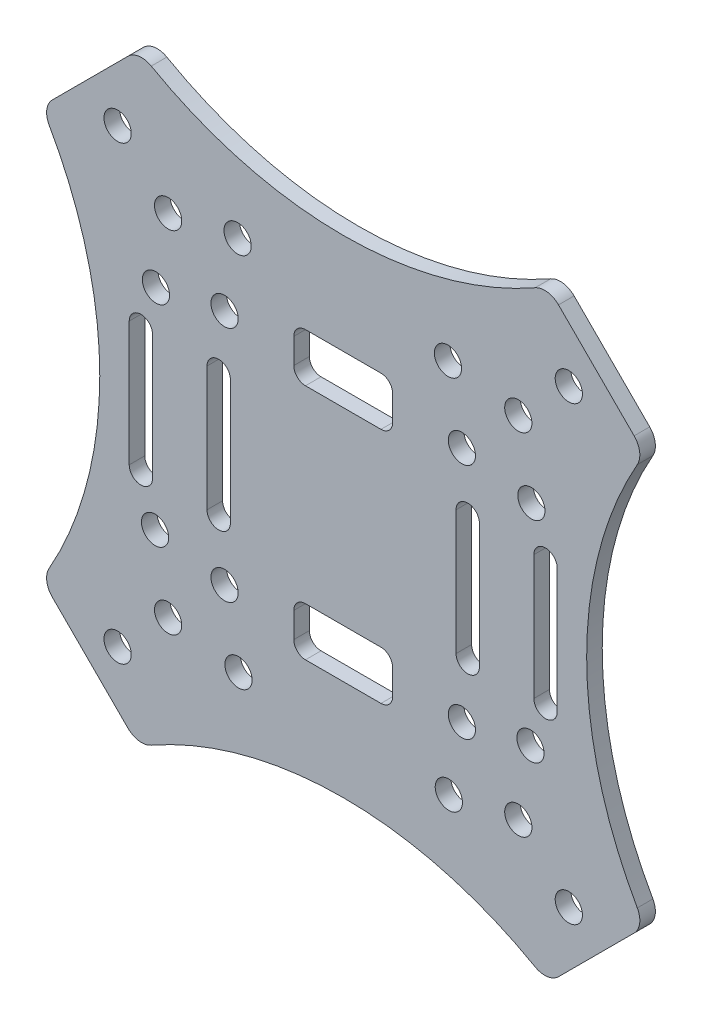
ISO-10303-21;
HEADER;
FILE_DESCRIPTION(('STEP AP214'),'2;1');
FILE_NAME('part.step','',(''),(''),'','','');
FILE_SCHEMA(('AUTOMOTIVE_DESIGN { 1 0 10303 214 1 1 1 1 }'));
ENDSEC;
DATA;
#1=APPLICATION_CONTEXT('core data for automotive mechanical design processes');
#2=APPLICATION_PROTOCOL_DEFINITION('international standard','automotive_design',2000,#1);
#3=PRODUCT_CONTEXT('',#1,'mechanical');
#4=PRODUCT('Part','Part','',(#3));
#5=PRODUCT_RELATED_PRODUCT_CATEGORY('part','',(#4));
#6=PRODUCT_DEFINITION_FORMATION('','',#4);
#7=PRODUCT_DEFINITION_CONTEXT('part definition',#1,'design');
#8=PRODUCT_DEFINITION('design','',#6,#7);
#9=PRODUCT_DEFINITION_SHAPE('','',#8);
#10=(LENGTH_UNIT() NAMED_UNIT(*) SI_UNIT(.MILLI.,.METRE.));
#11=(NAMED_UNIT(*) PLANE_ANGLE_UNIT() SI_UNIT($,.RADIAN.));
#12=(NAMED_UNIT(*) SI_UNIT($,.STERADIAN.) SOLID_ANGLE_UNIT());
#13=UNCERTAINTY_MEASURE_WITH_UNIT(LENGTH_MEASURE(1.E-05),#10,'distance_accuracy_value','');
#14=(GEOMETRIC_REPRESENTATION_CONTEXT(3) GLOBAL_UNCERTAINTY_ASSIGNED_CONTEXT((#13)) GLOBAL_UNIT_ASSIGNED_CONTEXT((#10,
#11,#12)) REPRESENTATION_CONTEXT('',''));
#15=CARTESIAN_POINT('',(0.,0.,0.));
#16=DIRECTION('',(0.,0.,1.));
#17=DIRECTION('',(1.,0.,0.));
#18=AXIS2_PLACEMENT_3D('',#15,#16,#17);
#19=CARTESIAN_POINT('',(25.9001959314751,35.6180940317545,2.));
#20=DIRECTION('',(0.,0.,1.));
#21=DIRECTION('',(1.,0.,0.));
#22=AXIS2_PLACEMENT_3D('',#19,#20,#21);
#23=PLANE('',#22);
#24=DIRECTION('',(0.,-1.,0.));
#25=VECTOR('',#24,1.);
#26=CARTESIAN_POINT('',(-6.35,16.875,2.));
#27=LINE('',#26,#25);
#28=CARTESIAN_POINT('',(-6.35,16.875,2.));
#29=VERTEX_POINT('',#28);
#30=CARTESIAN_POINT('',(-6.35,13.625,2.));
#31=VERTEX_POINT('',#30);
#32=EDGE_CURVE('E409',#29,#31,#27,.T.);
#33=ORIENTED_EDGE('',*,*,#32,.F.);
#34=CARTESIAN_POINT('',(-4.85,16.875,2.));
#35=DIRECTION('',(0.,0.,1.));
#36=DIRECTION('',(1.,0.,0.));
#37=AXIS2_PLACEMENT_3D('',#34,#35,#36);
#38=CIRCLE('',#37,1.5);
#39=CARTESIAN_POINT('',(-4.84999999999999,18.375,2.));
#40=VERTEX_POINT('',#39);
#41=EDGE_CURVE('E406',#40,#29,#38,.T.);
#42=ORIENTED_EDGE('',*,*,#41,.F.);
#43=DIRECTION('',(-1.,0.,0.));
#44=VECTOR('',#43,1.);
#45=CARTESIAN_POINT('',(0.,18.375,2.));
#46=LINE('',#45,#44);
#47=CARTESIAN_POINT('',(4.84999999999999,18.375,2.));
#48=VERTEX_POINT('',#47);
#49=EDGE_CURVE('E404',#48,#40,#46,.T.);
#50=ORIENTED_EDGE('',*,*,#49,.F.);
#51=CARTESIAN_POINT('',(4.85,16.875,2.));
#52=DIRECTION('',(0.,0.,1.));
#53=DIRECTION('',(-1.,0.,0.));
#54=AXIS2_PLACEMENT_3D('',#51,#52,#53);
#55=CIRCLE('',#54,1.5);
#56=CARTESIAN_POINT('',(6.35,16.875,2.));
#57=VERTEX_POINT('',#56);
#58=EDGE_CURVE('E419',#57,#48,#55,.T.);
#59=ORIENTED_EDGE('',*,*,#58,.F.);
#60=DIRECTION('',(0.,1.,0.));
#61=VECTOR('',#60,1.);
#62=CARTESIAN_POINT('',(6.35,16.875,2.));
#63=LINE('',#62,#61);
#64=CARTESIAN_POINT('',(6.35,13.625,2.));
#65=VERTEX_POINT('',#64);
#66=EDGE_CURVE('E417',#65,#57,#63,.T.);
#67=ORIENTED_EDGE('',*,*,#66,.F.);
#68=CARTESIAN_POINT('',(4.85,13.625,2.));
#69=DIRECTION('',(0.,0.,1.));
#70=DIRECTION('',(1.,0.,0.));
#71=AXIS2_PLACEMENT_3D('',#68,#69,#70);
#72=CIRCLE('',#71,1.5);
#73=CARTESIAN_POINT('',(4.84999999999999,12.125,2.));
#74=VERTEX_POINT('',#73);
#75=EDGE_CURVE('E415',#74,#65,#72,.T.);
#76=ORIENTED_EDGE('',*,*,#75,.F.);
#77=DIRECTION('',(1.,0.,0.));
#78=VECTOR('',#77,1.);
#79=CARTESIAN_POINT('',(0.,12.125,2.));
#80=LINE('',#79,#78);
#81=CARTESIAN_POINT('',(-4.84999999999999,12.125,2.));
#82=VERTEX_POINT('',#81);
#83=EDGE_CURVE('E413',#82,#74,#80,.T.);
#84=ORIENTED_EDGE('',*,*,#83,.F.);
#85=CARTESIAN_POINT('',(-4.85,13.625,2.));
#86=DIRECTION('',(0.,0.,1.));
#87=DIRECTION('',(-1.,0.,0.));
#88=AXIS2_PLACEMENT_3D('',#85,#86,#87);
#89=CIRCLE('',#88,1.5);
#90=EDGE_CURVE('E411',#31,#82,#89,.T.);
#91=ORIENTED_EDGE('',*,*,#90,.F.);
#92=EDGE_LOOP('',(#33,#42,#50,#59,#67,#76,#84,#91));
#93=FACE_BOUND('',#92,.T.);
#94=DIRECTION('',(0.,-1.,0.));
#95=VECTOR('',#94,1.);
#96=CARTESIAN_POINT('',(24.5,0.,2.));
#97=LINE('',#96,#95);
#98=CARTESIAN_POINT('',(24.5,8.,2.));
#99=VERTEX_POINT('',#98);
#100=CARTESIAN_POINT('',(24.5,-8.,2.));
#101=VERTEX_POINT('',#100);
#102=EDGE_CURVE('E499',#99,#101,#97,.T.);
#103=ORIENTED_EDGE('',*,*,#102,.F.);
#104=CARTESIAN_POINT('',(26.,8.,2.));
#105=DIRECTION('',(0.,0.,1.));
#106=DIRECTION('',(1.,0.,0.));
#107=AXIS2_PLACEMENT_3D('',#104,#105,#106);
#108=CIRCLE('',#107,1.5);
#109=CARTESIAN_POINT('',(27.5,8.,2.));
#110=VERTEX_POINT('',#109);
#111=EDGE_CURVE('E496',#110,#99,#108,.T.);
#112=ORIENTED_EDGE('',*,*,#111,.F.);
#113=DIRECTION('',(0.,1.,0.));
#114=VECTOR('',#113,1.);
#115=CARTESIAN_POINT('',(27.5,0.,2.));
#116=LINE('',#115,#114);
#117=CARTESIAN_POINT('',(27.5,-8.,2.));
#118=VERTEX_POINT('',#117);
#119=EDGE_CURVE('E494',#118,#110,#116,.T.);
#120=ORIENTED_EDGE('',*,*,#119,.F.);
#121=CARTESIAN_POINT('',(26.,-8.,2.));
#122=DIRECTION('',(0.,0.,1.));
#123=DIRECTION('',(-1.,0.,0.));
#124=AXIS2_PLACEMENT_3D('',#121,#122,#123);
#125=CIRCLE('',#124,1.5);
#126=EDGE_CURVE('E501',#101,#118,#125,.T.);
#127=ORIENTED_EDGE('',*,*,#126,.F.);
#128=EDGE_LOOP('',(#103,#112,#120,#127));
#129=FACE_BOUND('',#128,.T.);
#130=DIRECTION('',(0.,-1.,0.));
#131=VECTOR('',#130,1.);
#132=CARTESIAN_POINT('',(14.5,0.,2.));
#133=LINE('',#132,#131);
#134=CARTESIAN_POINT('',(14.5,8.,2.));
#135=VERTEX_POINT('',#134);
#136=CARTESIAN_POINT('',(14.5,-8.,2.));
#137=VERTEX_POINT('',#136);
#138=EDGE_CURVE('E559',#135,#137,#133,.T.);
#139=ORIENTED_EDGE('',*,*,#138,.F.);
#140=CARTESIAN_POINT('',(16.,8.,2.));
#141=DIRECTION('',(0.,0.,1.));
#142=DIRECTION('',(1.,0.,0.));
#143=AXIS2_PLACEMENT_3D('',#140,#141,#142);
#144=CIRCLE('',#143,1.5);
#145=CARTESIAN_POINT('',(17.5,8.,2.));
#146=VERTEX_POINT('',#145);
#147=EDGE_CURVE('E556',#146,#135,#144,.T.);
#148=ORIENTED_EDGE('',*,*,#147,.F.);
#149=DIRECTION('',(0.,1.,0.));
#150=VECTOR('',#149,1.);
#151=CARTESIAN_POINT('',(17.5,0.,2.));
#152=LINE('',#151,#150);
#153=CARTESIAN_POINT('',(17.5,-8.,2.));
#154=VERTEX_POINT('',#153);
#155=EDGE_CURVE('E554',#154,#146,#152,.T.);
#156=ORIENTED_EDGE('',*,*,#155,.F.);
#157=CARTESIAN_POINT('',(16.,-8.,2.));
#158=DIRECTION('',(0.,0.,1.));
#159=DIRECTION('',(-1.,0.,0.));
#160=AXIS2_PLACEMENT_3D('',#157,#158,#159);
#161=CIRCLE('',#160,1.5);
#162=EDGE_CURVE('E561',#137,#154,#161,.T.);
#163=ORIENTED_EDGE('',*,*,#162,.F.);
#164=EDGE_LOOP('',(#139,#148,#156,#163));
#165=FACE_BOUND('',#164,.T.);
#166=CARTESIAN_POINT('',(-13.5716991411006,24.1783008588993,2.));
#167=DIRECTION('',(0.,0.,1.));
#168=DIRECTION('',(1.,0.,0.));
#169=AXIS2_PLACEMENT_3D('',#166,#167,#168);
#170=CIRCLE('',#169,1.75);
#171=CARTESIAN_POINT('',(-11.8216991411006,24.1783008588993,2.));
#172=VERTEX_POINT('',#171);
#173=EDGE_CURVE('E590',#172,#172,#170,.T.);
#174=ORIENTED_EDGE('',*,*,#173,.F.);
#175=EDGE_LOOP('',(#174));
#176=FACE_BOUND('',#175,.T.);
#177=CARTESIAN_POINT('',(-13.4605384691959,-24.0647597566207,2.));
#178=DIRECTION('',(0.,0.,1.));
#179=DIRECTION('',(1.,0.,0.));
#180=AXIS2_PLACEMENT_3D('',#177,#178,#179);
#181=CIRCLE('',#180,1.75);
#182=CARTESIAN_POINT('',(-11.7105384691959,-24.0647597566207,2.));
#183=VERTEX_POINT('',#182);
#184=EDGE_CURVE('E602',#183,#183,#181,.T.);
#185=ORIENTED_EDGE('',*,*,#184,.F.);
#186=EDGE_LOOP('',(#185));
#187=FACE_BOUND('',#186,.T.);
#188=CARTESIAN_POINT('',(-28.9913780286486,-28.9913780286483,2.));
#189=DIRECTION('',(0.,0.,1.));
#190=DIRECTION('',(1.,0.,0.));
#191=AXIS2_PLACEMENT_3D('',#188,#189,#190);
#192=CIRCLE('',#191,1.75);
#193=CARTESIAN_POINT('',(-27.2413780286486,-28.9913780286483,2.));
#194=VERTEX_POINT('',#193);
#195=EDGE_CURVE('E614',#194,#194,#192,.T.);
#196=ORIENTED_EDGE('',*,*,#195,.F.);
#197=EDGE_LOOP('',(#196));
#198=FACE_BOUND('',#197,.T.);
#199=CARTESIAN_POINT('',(13.5716991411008,-24.1783008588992,2.));
#200=DIRECTION('',(0.,0.,1.));
#201=DIRECTION('',(1.,0.,0.));
#202=AXIS2_PLACEMENT_3D('',#199,#200,#201);
#203=CIRCLE('',#202,1.75);
#204=CARTESIAN_POINT('',(15.3216991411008,-24.1783008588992,2.));
#205=VERTEX_POINT('',#204);
#206=EDGE_CURVE('E626',#205,#205,#203,.T.);
#207=ORIENTED_EDGE('',*,*,#206,.F.);
#208=EDGE_LOOP('',(#207));
#209=FACE_BOUND('',#208,.T.);
#210=CARTESIAN_POINT('',(-22.5,-22.5,2.));
#211=DIRECTION('',(0.,0.,1.));
#212=DIRECTION('',(1.,0.,0.));
#213=AXIS2_PLACEMENT_3D('',#210,#211,#212);
#214=CIRCLE('',#213,1.75);
#215=CARTESIAN_POINT('',(-20.75,-22.5,2.));
#216=VERTEX_POINT('',#215);
#217=EDGE_CURVE('E638',#216,#216,#214,.T.);
#218=ORIENTED_EDGE('',*,*,#217,.F.);
#219=EDGE_LOOP('',(#218));
#220=FACE_BOUND('',#219,.T.);
#221=CARTESIAN_POINT('',(15.25,-15.25,2.));
#222=DIRECTION('',(0.,0.,1.));
#223=DIRECTION('',(1.,0.,0.));
#224=AXIS2_PLACEMENT_3D('',#221,#222,#223);
#225=CIRCLE('',#224,1.75);
#226=CARTESIAN_POINT('',(17.,-15.25,2.));
#227=VERTEX_POINT('',#226);
#228=EDGE_CURVE('E650',#227,#227,#225,.T.);
#229=ORIENTED_EDGE('',*,*,#228,.F.);
#230=EDGE_LOOP('',(#229));
#231=FACE_BOUND('',#230,.T.);
#232=CARTESIAN_POINT('',(-22.5,22.5,2.));
#233=DIRECTION('',(0.,0.,1.));
#234=DIRECTION('',(1.,0.,0.));
#235=AXIS2_PLACEMENT_3D('',#232,#233,#234);
#236=CIRCLE('',#235,1.75);
#237=CARTESIAN_POINT('',(-20.75,22.5,2.));
#238=VERTEX_POINT('',#237);
#239=EDGE_CURVE('E662',#238,#238,#236,.T.);
#240=ORIENTED_EDGE('',*,*,#239,.F.);
#241=EDGE_LOOP('',(#240));
#242=FACE_BOUND('',#241,.T.);
#243=CARTESIAN_POINT('',(15.25,15.25,2.));
#244=DIRECTION('',(0.,0.,1.));
#245=DIRECTION('',(1.,0.,0.));
#246=AXIS2_PLACEMENT_3D('',#243,#244,#245);
#247=CIRCLE('',#246,1.75);
#248=CARTESIAN_POINT('',(17.,15.25,2.));
#249=VERTEX_POINT('',#248);
#250=EDGE_CURVE('E674',#249,#249,#247,.T.);
#251=ORIENTED_EDGE('',*,*,#250,.F.);
#252=EDGE_LOOP('',(#251));
#253=FACE_BOUND('',#252,.T.);
#254=CARTESIAN_POINT('',(22.5,22.5,2.));
#255=DIRECTION('',(0.,0.,1.));
#256=DIRECTION('',(1.,0.,0.));
#257=AXIS2_PLACEMENT_3D('',#254,#255,#256);
#258=CIRCLE('',#257,1.75);
#259=CARTESIAN_POINT('',(24.25,22.5,2.));
#260=VERTEX_POINT('',#259);
#261=EDGE_CURVE('E686',#260,#260,#258,.T.);
#262=ORIENTED_EDGE('',*,*,#261,.F.);
#263=EDGE_LOOP('',(#262));
#264=FACE_BOUND('',#263,.T.);
#265=CARTESIAN_POINT('',(28.9913780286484,28.9913780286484,2.));
#266=DIRECTION('',(0.,0.,1.));
#267=DIRECTION('',(1.,0.,0.));
#268=AXIS2_PLACEMENT_3D('',#265,#266,#267);
#269=CIRCLE('',#268,1.75);
#270=CARTESIAN_POINT('',(30.7413780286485,28.9913780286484,2.));
#271=VERTEX_POINT('',#270);
#272=EDGE_CURVE('E698',#271,#271,#269,.T.);
#273=ORIENTED_EDGE('',*,*,#272,.F.);
#274=EDGE_LOOP('',(#273));
#275=FACE_BOUND('',#274,.T.);
#276=DIRECTION('',(-0.707106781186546,0.707106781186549,0.));
#277=VECTOR('',#276,1.);
#278=CARTESIAN_POINT('',(32.5269119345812,32.5269119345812,2.));
#279=LINE('',#278,#277);
#280=CARTESIAN_POINT('',(37.3858609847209,27.6679628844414,2.));
#281=VERTEX_POINT('',#280);
#282=CARTESIAN_POINT('',(27.6679628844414,37.3858609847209,2.));
#283=VERTEX_POINT('',#282);
#284=EDGE_CURVE('E704',#281,#283,#279,.T.);
#285=ORIENTED_EDGE('',*,*,#284,.T.);
#286=CARTESIAN_POINT('',(25.9001959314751,35.6180940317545,2.));
#287=DIRECTION('',(0.,0.,1.));
#288=DIRECTION('',(1.,0.,0.));
#289=AXIS2_PLACEMENT_3D('',#286,#287,#288);
#290=CIRCLE('',#289,2.5);
#291=CARTESIAN_POINT('',(24.6668532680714,37.792689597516,2.));
#292=VERTEX_POINT('',#291);
#293=EDGE_CURVE('E707',#283,#292,#290,.T.);
#294=ORIENTED_EDGE('',*,*,#293,.T.);
#295=CARTESIAN_POINT('',(0.,81.2846009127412,2.));
#296=DIRECTION('',(0.,0.,-1.));
#297=DIRECTION('',(1.,0.,0.));
#298=AXIS2_PLACEMENT_3D('',#295,#296,#297);
#299=CIRCLE('',#298,49.9999999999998);
#300=CARTESIAN_POINT('',(-24.6668532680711,37.7926895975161,2.));
#301=VERTEX_POINT('',#300);
#302=EDGE_CURVE('E710',#292,#301,#299,.T.);
#303=ORIENTED_EDGE('',*,*,#302,.T.);
#304=CARTESIAN_POINT('',(-25.9001959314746,35.6180940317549,2.));
#305=DIRECTION('',(0.,0.,1.));
#306=DIRECTION('',(-1.,0.,0.));
#307=AXIS2_PLACEMENT_3D('',#304,#305,#306);
#308=CIRCLE('',#307,2.5);
#309=CARTESIAN_POINT('',(-27.667962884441,37.3858609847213,2.));
#310=VERTEX_POINT('',#309);
#311=EDGE_CURVE('E712',#301,#310,#308,.T.);
#312=ORIENTED_EDGE('',*,*,#311,.T.);
#313=DIRECTION('',(-0.707106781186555,-0.70710678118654,0.));
#314=VECTOR('',#313,1.);
#315=CARTESIAN_POINT('',(-32.5269119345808,32.5269119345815,2.));
#316=LINE('',#315,#314);
#317=CARTESIAN_POINT('',(-37.3858609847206,27.6679628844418,2.));
#318=VERTEX_POINT('',#317);
#319=EDGE_CURVE('E714',#310,#318,#316,.T.);
#320=ORIENTED_EDGE('',*,*,#319,.T.);
#321=CARTESIAN_POINT('',(-35.6180940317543,25.9001959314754,2.));
#322=DIRECTION('',(0.,0.,1.));
#323=DIRECTION('',(1.,0.,0.));
#324=AXIS2_PLACEMENT_3D('',#321,#322,#323);
#325=CIRCLE('',#324,2.5);
#326=CARTESIAN_POINT('',(-37.7926895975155,24.6668532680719,2.));
#327=VERTEX_POINT('',#326);
#328=EDGE_CURVE('E716',#318,#327,#325,.T.);
#329=ORIENTED_EDGE('',*,*,#328,.T.);
#330=CARTESIAN_POINT('',(-81.2846009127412,9.03344941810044E-13,2.));
#331=DIRECTION('',(0.,0.,-1.));
#332=DIRECTION('',(1.,0.,0.));
#333=AXIS2_PLACEMENT_3D('',#330,#331,#332);
#334=CIRCLE('',#333,50.0000000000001);
#335=CARTESIAN_POINT('',(-37.792689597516,-24.6668532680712,2.));
#336=VERTEX_POINT('',#335);
#337=EDGE_CURVE('E718',#327,#336,#334,.T.);
#338=ORIENTED_EDGE('',*,*,#337,.T.);
#339=CARTESIAN_POINT('',(-35.6180940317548,-25.9001959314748,2.));
#340=DIRECTION('',(0.,0.,1.));
#341=DIRECTION('',(-1.,0.,0.));
#342=AXIS2_PLACEMENT_3D('',#339,#340,#341);
#343=CIRCLE('',#342,2.50000000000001);
#344=CARTESIAN_POINT('',(-37.3858609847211,-27.6679628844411,2.));
#345=VERTEX_POINT('',#344);
#346=EDGE_CURVE('E720',#336,#345,#343,.T.);
#347=ORIENTED_EDGE('',*,*,#346,.T.);
#348=DIRECTION('',(0.707106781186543,-0.707106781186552,0.));
#349=VECTOR('',#348,1.);
#350=CARTESIAN_POINT('',(-32.5269119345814,-32.5269119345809,2.));
#351=LINE('',#350,#349);
#352=CARTESIAN_POINT('',(-27.6679628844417,-37.3858609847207,2.));
#353=VERTEX_POINT('',#352);
#354=EDGE_CURVE('E722',#345,#353,#351,.T.);
#355=ORIENTED_EDGE('',*,*,#354,.T.);
#356=CARTESIAN_POINT('',(-25.9001959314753,-35.6180940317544,2.));
#357=DIRECTION('',(0.,0.,1.));
#358=DIRECTION('',(1.,0.,0.));
#359=AXIS2_PLACEMENT_3D('',#356,#357,#358);
#360=CIRCLE('',#359,2.50000000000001);
#361=CARTESIAN_POINT('',(-24.6668532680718,-37.7926895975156,2.));
#362=VERTEX_POINT('',#361);
#363=EDGE_CURVE('E724',#353,#362,#360,.T.);
#364=ORIENTED_EDGE('',*,*,#363,.T.);
#365=CARTESIAN_POINT('',(-6.19541274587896E-13,-81.2846009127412,2.));
#366=DIRECTION('',(0.,0.,-1.));
#367=DIRECTION('',(1.,0.,0.));
#368=AXIS2_PLACEMENT_3D('',#365,#366,#367);
#369=CIRCLE('',#368,50.0000000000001);
#370=CARTESIAN_POINT('',(24.6668532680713,-37.7926895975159,2.));
#371=VERTEX_POINT('',#370);
#372=EDGE_CURVE('E726',#362,#371,#369,.T.);
#373=ORIENTED_EDGE('',*,*,#372,.T.);
#374=CARTESIAN_POINT('',(25.9001959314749,-35.6180940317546,2.));
#375=DIRECTION('',(0.,0.,1.));
#376=DIRECTION('',(-1.,0.,0.));
#377=AXIS2_PLACEMENT_3D('',#374,#375,#376);
#378=CIRCLE('',#377,2.50000000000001);
#379=CARTESIAN_POINT('',(27.6679628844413,-37.385860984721,2.));
#380=VERTEX_POINT('',#379);
#381=EDGE_CURVE('E728',#371,#380,#378,.T.);
#382=ORIENTED_EDGE('',*,*,#381,.T.);
#383=DIRECTION('',(0.70710678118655,0.707106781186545,0.));
#384=VECTOR('',#383,1.);
#385=CARTESIAN_POINT('',(32.5269119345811,-32.5269119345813,2.));
#386=LINE('',#385,#384);
#387=CARTESIAN_POINT('',(37.3858609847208,-27.6679628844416,2.));
#388=VERTEX_POINT('',#387);
#389=EDGE_CURVE('E730',#380,#388,#386,.T.);
#390=ORIENTED_EDGE('',*,*,#389,.T.);
#391=CARTESIAN_POINT('',(35.6180940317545,-25.9001959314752,2.));
#392=DIRECTION('',(0.,0.,1.));
#393=DIRECTION('',(1.,0.,0.));
#394=AXIS2_PLACEMENT_3D('',#391,#392,#393);
#395=CIRCLE('',#394,2.49999999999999);
#396=CARTESIAN_POINT('',(37.7926895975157,-24.6668532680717,2.));
#397=VERTEX_POINT('',#396);
#398=EDGE_CURVE('E732',#388,#397,#395,.T.);
#399=ORIENTED_EDGE('',*,*,#398,.T.);
#400=CARTESIAN_POINT('',(81.2846009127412,-3.35737607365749E-13,2.));
#401=DIRECTION('',(0.,0.,-1.));
#402=DIRECTION('',(1.,0.,0.));
#403=AXIS2_PLACEMENT_3D('',#400,#401,#402);
#404=CIRCLE('',#403,50.0000000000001);
#405=CARTESIAN_POINT('',(37.7926895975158,24.6668532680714,2.));
#406=VERTEX_POINT('',#405);
#407=EDGE_CURVE('E734',#397,#406,#404,.T.);
#408=ORIENTED_EDGE('',*,*,#407,.T.);
#409=CARTESIAN_POINT('',(35.6180940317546,25.900195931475,2.));
#410=DIRECTION('',(0.,0.,1.));
#411=DIRECTION('',(-1.,0.,0.));
#412=AXIS2_PLACEMENT_3D('',#409,#410,#411);
#413=CIRCLE('',#412,2.49999999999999);
#414=EDGE_CURVE('E736',#406,#281,#413,.T.);
#415=ORIENTED_EDGE('',*,*,#414,.T.);
#416=EDGE_LOOP('',(#285,#294,#303,#312,#320,#329,#338,#347,#355,#364,#373,#382,#390,#399,#408,#415));
#417=FACE_BOUND('',#416,.T.);
#418=CARTESIAN_POINT('',(24.1783008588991,13.5716991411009,2.));
#419=DIRECTION('',(0.,0.,1.));
#420=DIRECTION('',(1.,0.,0.));
#421=AXIS2_PLACEMENT_3D('',#418,#419,#420);
#422=CIRCLE('',#421,1.75);
#423=CARTESIAN_POINT('',(25.9283008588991,13.5716991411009,2.));
#424=VERTEX_POINT('',#423);
#425=EDGE_CURVE('E692',#424,#424,#422,.T.);
#426=ORIENTED_EDGE('',*,*,#425,.F.);
#427=EDGE_LOOP('',(#426));
#428=FACE_BOUND('',#427,.T.);
#429=CARTESIAN_POINT('',(13.4605384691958,24.0647597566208,2.));
#430=DIRECTION('',(0.,0.,1.));
#431=DIRECTION('',(1.,0.,0.));
#432=AXIS2_PLACEMENT_3D('',#429,#430,#431);
#433=CIRCLE('',#432,1.75);
#434=CARTESIAN_POINT('',(15.2105384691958,24.0647597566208,2.));
#435=VERTEX_POINT('',#434);
#436=EDGE_CURVE('E680',#435,#435,#433,.T.);
#437=ORIENTED_EDGE('',*,*,#436,.F.);
#438=EDGE_LOOP('',(#437));
#439=FACE_BOUND('',#438,.T.);
#440=CARTESIAN_POINT('',(-15.25,15.25,2.));
#441=DIRECTION('',(0.,0.,1.));
#442=DIRECTION('',(1.,0.,0.));
#443=AXIS2_PLACEMENT_3D('',#440,#441,#442);
#444=CIRCLE('',#443,1.75);
#445=CARTESIAN_POINT('',(-13.5,15.25,2.));
#446=VERTEX_POINT('',#445);
#447=EDGE_CURVE('E668',#446,#446,#444,.T.);
#448=ORIENTED_EDGE('',*,*,#447,.F.);
#449=EDGE_LOOP('',(#448));
#450=FACE_BOUND('',#449,.T.);
#451=CARTESIAN_POINT('',(-15.25,-15.25,2.));
#452=DIRECTION('',(0.,0.,1.));
#453=DIRECTION('',(1.,0.,0.));
#454=AXIS2_PLACEMENT_3D('',#451,#452,#453);
#455=CIRCLE('',#454,1.75);
#456=CARTESIAN_POINT('',(-13.5,-15.25,2.));
#457=VERTEX_POINT('',#456);
#458=EDGE_CURVE('E656',#457,#457,#455,.T.);
#459=ORIENTED_EDGE('',*,*,#458,.F.);
#460=EDGE_LOOP('',(#459));
#461=FACE_BOUND('',#460,.T.);
#462=CARTESIAN_POINT('',(22.5,-22.5,2.));
#463=DIRECTION('',(0.,0.,1.));
#464=DIRECTION('',(1.,0.,0.));
#465=AXIS2_PLACEMENT_3D('',#462,#463,#464);
#466=CIRCLE('',#465,1.75);
#467=CARTESIAN_POINT('',(24.25,-22.5,2.));
#468=VERTEX_POINT('',#467);
#469=EDGE_CURVE('E644',#468,#468,#466,.T.);
#470=ORIENTED_EDGE('',*,*,#469,.F.);
#471=EDGE_LOOP('',(#470));
#472=FACE_BOUND('',#471,.T.);
#473=CARTESIAN_POINT('',(28.9913780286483,-28.9913780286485,2.));
#474=DIRECTION('',(0.,0.,1.));
#475=DIRECTION('',(1.,0.,0.));
#476=AXIS2_PLACEMENT_3D('',#473,#474,#475);
#477=CIRCLE('',#476,1.75000000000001);
#478=CARTESIAN_POINT('',(30.7413780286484,-28.9913780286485,2.));
#479=VERTEX_POINT('',#478);
#480=EDGE_CURVE('E632',#479,#479,#477,.T.);
#481=ORIENTED_EDGE('',*,*,#480,.F.);
#482=EDGE_LOOP('',(#481));
#483=FACE_BOUND('',#482,.T.);
#484=CARTESIAN_POINT('',(24.0647597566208,-13.4605384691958,2.));
#485=DIRECTION('',(0.,0.,1.));
#486=DIRECTION('',(1.,0.,0.));
#487=AXIS2_PLACEMENT_3D('',#484,#485,#486);
#488=CIRCLE('',#487,1.75);
#489=CARTESIAN_POINT('',(25.8147597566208,-13.4605384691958,2.));
#490=VERTEX_POINT('',#489);
#491=EDGE_CURVE('E620',#490,#490,#488,.T.);
#492=ORIENTED_EDGE('',*,*,#491,.F.);
#493=EDGE_LOOP('',(#492));
#494=FACE_BOUND('',#493,.T.);
#495=CARTESIAN_POINT('',(-24.1783008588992,-13.5716991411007,2.));
#496=DIRECTION('',(0.,0.,1.));
#497=DIRECTION('',(1.,0.,0.));
#498=AXIS2_PLACEMENT_3D('',#495,#496,#497);
#499=CIRCLE('',#498,1.75);
#500=CARTESIAN_POINT('',(-22.4283008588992,-13.5716991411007,2.));
#501=VERTEX_POINT('',#500);
#502=EDGE_CURVE('E608',#501,#501,#499,.T.);
#503=ORIENTED_EDGE('',*,*,#502,.F.);
#504=EDGE_LOOP('',(#503));
#505=FACE_BOUND('',#504,.T.);
#506=CARTESIAN_POINT('',(-28.9913780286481,28.9913780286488,2.));
#507=DIRECTION('',(0.,0.,1.));
#508=DIRECTION('',(1.,0.,0.));
#509=AXIS2_PLACEMENT_3D('',#506,#507,#508);
#510=CIRCLE('',#509,1.75);
#511=CARTESIAN_POINT('',(-27.2413780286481,28.9913780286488,2.));
#512=VERTEX_POINT('',#511);
#513=EDGE_CURVE('E596',#512,#512,#510,.T.);
#514=ORIENTED_EDGE('',*,*,#513,.F.);
#515=EDGE_LOOP('',(#514));
#516=FACE_BOUND('',#515,.T.);
#517=CARTESIAN_POINT('',(-24.0647597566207,13.460538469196,2.));
#518=DIRECTION('',(0.,0.,1.));
#519=DIRECTION('',(1.,0.,0.));
#520=AXIS2_PLACEMENT_3D('',#517,#518,#519);
#521=CIRCLE('',#520,1.75);
#522=CARTESIAN_POINT('',(-22.3147597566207,13.460538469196,2.));
#523=VERTEX_POINT('',#522);
#524=EDGE_CURVE('E584',#523,#523,#521,.T.);
#525=ORIENTED_EDGE('',*,*,#524,.F.);
#526=EDGE_LOOP('',(#525));
#527=FACE_BOUND('',#526,.T.);
#528=CARTESIAN_POINT('',(-26.,-8.,2.));
#529=DIRECTION('',(0.,0.,1.));
#530=DIRECTION('',(1.,0.,0.));
#531=AXIS2_PLACEMENT_3D('',#528,#529,#530);
#532=CIRCLE('',#531,1.5);
#533=CARTESIAN_POINT('',(-27.5,-8.,2.));
#534=VERTEX_POINT('',#533);
#535=CARTESIAN_POINT('',(-24.5,-8.,2.));
#536=VERTEX_POINT('',#535);
#537=EDGE_CURVE('E526',#534,#536,#532,.T.);
#538=ORIENTED_EDGE('',*,*,#537,.F.);
#539=DIRECTION('',(0.,-1.,0.));
#540=VECTOR('',#539,1.);
#541=CARTESIAN_POINT('',(-27.5,0.,2.));
#542=LINE('',#541,#540);
#543=CARTESIAN_POINT('',(-27.5,8.,2.));
#544=VERTEX_POINT('',#543);
#545=EDGE_CURVE('E524',#544,#534,#542,.T.);
#546=ORIENTED_EDGE('',*,*,#545,.F.);
#547=CARTESIAN_POINT('',(-26.,8.,2.));
#548=DIRECTION('',(0.,0.,1.));
#549=DIRECTION('',(-1.,0.,0.));
#550=AXIS2_PLACEMENT_3D('',#547,#548,#549);
#551=CIRCLE('',#550,1.5);
#552=CARTESIAN_POINT('',(-24.5,8.,2.));
#553=VERTEX_POINT('',#552);
#554=EDGE_CURVE('E532',#553,#544,#551,.T.);
#555=ORIENTED_EDGE('',*,*,#554,.F.);
#556=DIRECTION('',(0.,1.,0.));
#557=VECTOR('',#556,1.);
#558=CARTESIAN_POINT('',(-24.5,0.,2.));
#559=LINE('',#558,#557);
#560=EDGE_CURVE('E529',#536,#553,#559,.T.);
#561=ORIENTED_EDGE('',*,*,#560,.F.);
#562=EDGE_LOOP('',(#538,#546,#555,#561));
#563=FACE_BOUND('',#562,.T.);
#564=DIRECTION('',(0.,-1.,0.));
#565=VECTOR('',#564,1.);
#566=CARTESIAN_POINT('',(-17.5,0.,2.));
#567=LINE('',#566,#565);
#568=CARTESIAN_POINT('',(-17.5,8.,2.));
#569=VERTEX_POINT('',#568);
#570=CARTESIAN_POINT('',(-17.5,-8.,2.));
#571=VERTEX_POINT('',#570);
#572=EDGE_CURVE('E464',#569,#571,#567,.T.);
#573=ORIENTED_EDGE('',*,*,#572,.F.);
#574=CARTESIAN_POINT('',(-16.,8.,2.));
#575=DIRECTION('',(0.,0.,1.));
#576=DIRECTION('',(-1.,0.,0.));
#577=AXIS2_PLACEMENT_3D('',#574,#575,#576);
#578=CIRCLE('',#577,1.5);
#579=CARTESIAN_POINT('',(-14.5,8.,2.));
#580=VERTEX_POINT('',#579);
#581=EDGE_CURVE('E462',#580,#569,#578,.T.);
#582=ORIENTED_EDGE('',*,*,#581,.F.);
#583=DIRECTION('',(0.,1.,0.));
#584=VECTOR('',#583,1.);
#585=CARTESIAN_POINT('',(-14.5,0.,2.));
#586=LINE('',#585,#584);
#587=CARTESIAN_POINT('',(-14.5,-8.,2.));
#588=VERTEX_POINT('',#587);
#589=EDGE_CURVE('E470',#588,#580,#586,.T.);
#590=ORIENTED_EDGE('',*,*,#589,.F.);
#591=CARTESIAN_POINT('',(-16.,-8.,2.));
#592=DIRECTION('',(0.,0.,1.));
#593=DIRECTION('',(1.,0.,0.));
#594=AXIS2_PLACEMENT_3D('',#591,#592,#593);
#595=CIRCLE('',#594,1.5);
#596=EDGE_CURVE('E467',#571,#588,#595,.T.);
#597=ORIENTED_EDGE('',*,*,#596,.F.);
#598=EDGE_LOOP('',(#573,#582,#590,#597));
#599=FACE_BOUND('',#598,.T.);
#600=DIRECTION('',(-1.,0.,0.));
#601=VECTOR('',#600,1.);
#602=CARTESIAN_POINT('',(0.,-12.125,2.));
#603=LINE('',#602,#601);
#604=CARTESIAN_POINT('',(4.84999999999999,-12.125,2.));
#605=VERTEX_POINT('',#604);
#606=CARTESIAN_POINT('',(-4.84999999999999,-12.125,2.));
#607=VERTEX_POINT('',#606);
#608=EDGE_CURVE('E346',#605,#607,#603,.T.);
#609=ORIENTED_EDGE('',*,*,#608,.F.);
#610=CARTESIAN_POINT('',(4.85,-13.625,2.));
#611=DIRECTION('',(0.,0.,1.));
#612=DIRECTION('',(-1.,0.,0.));
#613=AXIS2_PLACEMENT_3D('',#610,#611,#612);
#614=CIRCLE('',#613,1.5);
#615=CARTESIAN_POINT('',(6.35,-13.625,2.));
#616=VERTEX_POINT('',#615);
#617=EDGE_CURVE('E338',#616,#605,#614,.T.);
#618=ORIENTED_EDGE('',*,*,#617,.F.);
#619=DIRECTION('',(0.,1.,0.));
#620=VECTOR('',#619,1.);
#621=CARTESIAN_POINT('',(6.35,-16.875,2.));
#622=LINE('',#621,#620);
#623=CARTESIAN_POINT('',(6.35,-16.875,2.));
#624=VERTEX_POINT('',#623);
#625=EDGE_CURVE('E371',#624,#616,#622,.T.);
#626=ORIENTED_EDGE('',*,*,#625,.F.);
#627=CARTESIAN_POINT('',(4.85,-16.875,2.));
#628=DIRECTION('',(0.,0.,1.));
#629=DIRECTION('',(1.,0.,0.));
#630=AXIS2_PLACEMENT_3D('',#627,#628,#629);
#631=CIRCLE('',#630,1.5);
#632=CARTESIAN_POINT('',(4.84999999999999,-18.375,2.));
#633=VERTEX_POINT('',#632);
#634=EDGE_CURVE('E369',#633,#624,#631,.T.);
#635=ORIENTED_EDGE('',*,*,#634,.F.);
#636=DIRECTION('',(1.,0.,0.));
#637=VECTOR('',#636,1.);
#638=CARTESIAN_POINT('',(0.,-18.375,2.));
#639=LINE('',#638,#637);
#640=CARTESIAN_POINT('',(-4.84999999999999,-18.375,2.));
#641=VERTEX_POINT('',#640);
#642=EDGE_CURVE('E367',#641,#633,#639,.T.);
#643=ORIENTED_EDGE('',*,*,#642,.F.);
#644=CARTESIAN_POINT('',(-4.85,-16.875,2.));
#645=DIRECTION('',(0.,0.,1.));
#646=DIRECTION('',(-1.,0.,0.));
#647=AXIS2_PLACEMENT_3D('',#644,#645,#646);
#648=CIRCLE('',#647,1.5);
#649=CARTESIAN_POINT('',(-6.35,-16.875,2.));
#650=VERTEX_POINT('',#649);
#651=EDGE_CURVE('E365',#650,#641,#648,.T.);
#652=ORIENTED_EDGE('',*,*,#651,.F.);
#653=DIRECTION('',(0.,-1.,0.));
#654=VECTOR('',#653,1.);
#655=CARTESIAN_POINT('',(-6.35,-16.875,2.));
#656=LINE('',#655,#654);
#657=CARTESIAN_POINT('',(-6.35,-13.625,2.));
#658=VERTEX_POINT('',#657);
#659=EDGE_CURVE('E361',#658,#650,#656,.T.);
#660=ORIENTED_EDGE('',*,*,#659,.F.);
#661=CARTESIAN_POINT('',(-4.85,-13.625,2.));
#662=DIRECTION('',(0.,0.,1.));
#663=DIRECTION('',(1.,0.,0.));
#664=AXIS2_PLACEMENT_3D('',#661,#662,#663);
#665=CIRCLE('',#664,1.5);
#666=EDGE_CURVE('E359',#607,#658,#665,.T.);
#667=ORIENTED_EDGE('',*,*,#666,.F.);
#668=EDGE_LOOP('',(#609,#618,#626,#635,#643,#652,#660,#667));
#669=FACE_BOUND('',#668,.T.);
#670=ADVANCED_FACE('F33',(#93,#129,#165,#176,#187,#198,#209,#220,#231,#242,#253,#264,#275,#417,
#428,#439,#450,#461,#472,#483,#494,#505,#516,#527,#563,#599,#669),#23,.T.);
#671=CARTESIAN_POINT('',(25.9001959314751,35.6180940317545,0.));
#672=DIRECTION('',(0.,0.,1.));
#673=DIRECTION('',(1.,0.,0.));
#674=AXIS2_PLACEMENT_3D('',#671,#672,#673);
#675=PLANE('',#674);
#676=CARTESIAN_POINT('',(-4.85,16.875,0.));
#677=DIRECTION('',(0.,0.,1.));
#678=DIRECTION('',(1.,0.,0.));
#679=AXIS2_PLACEMENT_3D('',#676,#677,#678);
#680=CIRCLE('',#679,1.5);
#681=CARTESIAN_POINT('',(-4.84999999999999,18.375,0.));
#682=VERTEX_POINT('',#681);
#683=CARTESIAN_POINT('',(-6.35,16.875,0.));
#684=VERTEX_POINT('',#683);
#685=EDGE_CURVE('E354',#682,#684,#680,.T.);
#686=ORIENTED_EDGE('',*,*,#685,.T.);
#687=DIRECTION('',(0.,-1.,0.));
#688=VECTOR('',#687,1.);
#689=CARTESIAN_POINT('',(-6.35,16.875,0.));
#690=LINE('',#689,#688);
#691=CARTESIAN_POINT('',(-6.35,13.625,0.));
#692=VERTEX_POINT('',#691);
#693=EDGE_CURVE('E425',#684,#692,#690,.T.);
#694=ORIENTED_EDGE('',*,*,#693,.T.);
#695=CARTESIAN_POINT('',(-4.85,13.625,0.));
#696=DIRECTION('',(0.,0.,1.));
#697=DIRECTION('',(-1.,0.,0.));
#698=AXIS2_PLACEMENT_3D('',#695,#696,#697);
#699=CIRCLE('',#698,1.5);
#700=CARTESIAN_POINT('',(-4.84999999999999,12.125,0.));
#701=VERTEX_POINT('',#700);
#702=EDGE_CURVE('E428',#692,#701,#699,.T.);
#703=ORIENTED_EDGE('',*,*,#702,.T.);
#704=DIRECTION('',(1.,0.,0.));
#705=VECTOR('',#704,1.);
#706=CARTESIAN_POINT('',(0.,12.125,0.));
#707=LINE('',#706,#705);
#708=CARTESIAN_POINT('',(4.84999999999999,12.125,0.));
#709=VERTEX_POINT('',#708);
#710=EDGE_CURVE('E431',#701,#709,#707,.T.);
#711=ORIENTED_EDGE('',*,*,#710,.T.);
#712=CARTESIAN_POINT('',(4.85,13.625,0.));
#713=DIRECTION('',(0.,0.,1.));
#714=DIRECTION('',(1.,0.,0.));
#715=AXIS2_PLACEMENT_3D('',#712,#713,#714);
#716=CIRCLE('',#715,1.5);
#717=CARTESIAN_POINT('',(6.35,13.625,0.));
#718=VERTEX_POINT('',#717);
#719=EDGE_CURVE('E434',#709,#718,#716,.T.);
#720=ORIENTED_EDGE('',*,*,#719,.T.);
#721=DIRECTION('',(0.,1.,0.));
#722=VECTOR('',#721,1.);
#723=CARTESIAN_POINT('',(6.35,16.875,0.));
#724=LINE('',#723,#722);
#725=CARTESIAN_POINT('',(6.35,16.875,0.));
#726=VERTEX_POINT('',#725);
#727=EDGE_CURVE('E437',#718,#726,#724,.T.);
#728=ORIENTED_EDGE('',*,*,#727,.T.);
#729=CARTESIAN_POINT('',(4.85,16.875,0.));
#730=DIRECTION('',(0.,0.,1.));
#731=DIRECTION('',(-1.,0.,0.));
#732=AXIS2_PLACEMENT_3D('',#729,#730,#731);
#733=CIRCLE('',#732,1.5);
#734=CARTESIAN_POINT('',(4.84999999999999,18.375,0.));
#735=VERTEX_POINT('',#734);
#736=EDGE_CURVE('E440',#726,#735,#733,.T.);
#737=ORIENTED_EDGE('',*,*,#736,.T.);
#738=DIRECTION('',(-1.,0.,0.));
#739=VECTOR('',#738,1.);
#740=CARTESIAN_POINT('',(0.,18.375,0.));
#741=LINE('',#740,#739);
#742=EDGE_CURVE('E407',#735,#682,#741,.T.);
#743=ORIENTED_EDGE('',*,*,#742,.T.);
#744=EDGE_LOOP('',(#686,#694,#703,#711,#720,#728,#737,#743));
#745=FACE_BOUND('',#744,.T.);
#746=CARTESIAN_POINT('',(26.,8.,0.));
#747=DIRECTION('',(0.,0.,1.));
#748=DIRECTION('',(1.,0.,0.));
#749=AXIS2_PLACEMENT_3D('',#746,#747,#748);
#750=CIRCLE('',#749,1.5);
#751=CARTESIAN_POINT('',(27.5,8.,0.));
#752=VERTEX_POINT('',#751);
#753=CARTESIAN_POINT('',(24.5,8.,0.));
#754=VERTEX_POINT('',#753);
#755=EDGE_CURVE('E493',#752,#754,#750,.T.);
#756=ORIENTED_EDGE('',*,*,#755,.T.);
#757=DIRECTION('',(0.,-1.,0.));
#758=VECTOR('',#757,1.);
#759=CARTESIAN_POINT('',(24.5,0.,0.));
#760=LINE('',#759,#758);
#761=CARTESIAN_POINT('',(24.5,-8.,0.));
#762=VERTEX_POINT('',#761);
#763=EDGE_CURVE('E507',#754,#762,#760,.T.);
#764=ORIENTED_EDGE('',*,*,#763,.T.);
#765=CARTESIAN_POINT('',(26.,-8.,0.));
#766=DIRECTION('',(0.,0.,1.));
#767=DIRECTION('',(-1.,0.,0.));
#768=AXIS2_PLACEMENT_3D('',#765,#766,#767);
#769=CIRCLE('',#768,1.5);
#770=CARTESIAN_POINT('',(27.5,-8.,0.));
#771=VERTEX_POINT('',#770);
#772=EDGE_CURVE('E510',#762,#771,#769,.T.);
#773=ORIENTED_EDGE('',*,*,#772,.T.);
#774=DIRECTION('',(0.,1.,0.));
#775=VECTOR('',#774,1.);
#776=CARTESIAN_POINT('',(27.5,0.,0.));
#777=LINE('',#776,#775);
#778=EDGE_CURVE('E497',#771,#752,#777,.T.);
#779=ORIENTED_EDGE('',*,*,#778,.T.);
#780=EDGE_LOOP('',(#756,#764,#773,#779));
#781=FACE_BOUND('',#780,.T.);
#782=CARTESIAN_POINT('',(16.,8.,0.));
#783=DIRECTION('',(0.,0.,1.));
#784=DIRECTION('',(1.,0.,0.));
#785=AXIS2_PLACEMENT_3D('',#782,#783,#784);
#786=CIRCLE('',#785,1.5);
#787=CARTESIAN_POINT('',(17.5,8.,0.));
#788=VERTEX_POINT('',#787);
#789=CARTESIAN_POINT('',(14.5,8.,0.));
#790=VERTEX_POINT('',#789);
#791=EDGE_CURVE('E553',#788,#790,#786,.T.);
#792=ORIENTED_EDGE('',*,*,#791,.T.);
#793=DIRECTION('',(0.,-1.,0.));
#794=VECTOR('',#793,1.);
#795=CARTESIAN_POINT('',(14.5,0.,0.));
#796=LINE('',#795,#794);
#797=CARTESIAN_POINT('',(14.5,-8.,0.));
#798=VERTEX_POINT('',#797);
#799=EDGE_CURVE('E567',#790,#798,#796,.T.);
#800=ORIENTED_EDGE('',*,*,#799,.T.);
#801=CARTESIAN_POINT('',(16.,-8.,0.));
#802=DIRECTION('',(0.,0.,1.));
#803=DIRECTION('',(-1.,0.,0.));
#804=AXIS2_PLACEMENT_3D('',#801,#802,#803);
#805=CIRCLE('',#804,1.5);
#806=CARTESIAN_POINT('',(17.5,-8.,0.));
#807=VERTEX_POINT('',#806);
#808=EDGE_CURVE('E570',#798,#807,#805,.T.);
#809=ORIENTED_EDGE('',*,*,#808,.T.);
#810=DIRECTION('',(0.,1.,0.));
#811=VECTOR('',#810,1.);
#812=CARTESIAN_POINT('',(17.5,0.,0.));
#813=LINE('',#812,#811);
#814=EDGE_CURVE('E557',#807,#788,#813,.T.);
#815=ORIENTED_EDGE('',*,*,#814,.T.);
#816=EDGE_LOOP('',(#792,#800,#809,#815));
#817=FACE_BOUND('',#816,.T.);
#818=CARTESIAN_POINT('',(-13.5716991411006,24.1783008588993,0.));
#819=DIRECTION('',(0.,0.,1.));
#820=DIRECTION('',(1.,0.,0.));
#821=AXIS2_PLACEMENT_3D('',#818,#819,#820);
#822=CIRCLE('',#821,1.75);
#823=CARTESIAN_POINT('',(-11.8216991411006,24.1783008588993,0.));
#824=VERTEX_POINT('',#823);
#825=EDGE_CURVE('E587',#824,#824,#822,.T.);
#826=ORIENTED_EDGE('',*,*,#825,.T.);
#827=EDGE_LOOP('',(#826));
#828=FACE_BOUND('',#827,.T.);
#829=CARTESIAN_POINT('',(-13.4605384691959,-24.0647597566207,0.));
#830=DIRECTION('',(0.,0.,1.));
#831=DIRECTION('',(1.,0.,0.));
#832=AXIS2_PLACEMENT_3D('',#829,#830,#831);
#833=CIRCLE('',#832,1.75);
#834=CARTESIAN_POINT('',(-11.7105384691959,-24.0647597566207,0.));
#835=VERTEX_POINT('',#834);
#836=EDGE_CURVE('E599',#835,#835,#833,.T.);
#837=ORIENTED_EDGE('',*,*,#836,.T.);
#838=EDGE_LOOP('',(#837));
#839=FACE_BOUND('',#838,.T.);
#840=CARTESIAN_POINT('',(-28.9913780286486,-28.9913780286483,0.));
#841=DIRECTION('',(0.,0.,1.));
#842=DIRECTION('',(1.,0.,0.));
#843=AXIS2_PLACEMENT_3D('',#840,#841,#842);
#844=CIRCLE('',#843,1.75);
#845=CARTESIAN_POINT('',(-27.2413780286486,-28.9913780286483,0.));
#846=VERTEX_POINT('',#845);
#847=EDGE_CURVE('E611',#846,#846,#844,.T.);
#848=ORIENTED_EDGE('',*,*,#847,.T.);
#849=EDGE_LOOP('',(#848));
#850=FACE_BOUND('',#849,.T.);
#851=CARTESIAN_POINT('',(13.5716991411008,-24.1783008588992,0.));
#852=DIRECTION('',(0.,0.,1.));
#853=DIRECTION('',(1.,0.,0.));
#854=AXIS2_PLACEMENT_3D('',#851,#852,#853);
#855=CIRCLE('',#854,1.75);
#856=CARTESIAN_POINT('',(15.3216991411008,-24.1783008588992,0.));
#857=VERTEX_POINT('',#856);
#858=EDGE_CURVE('E623',#857,#857,#855,.T.);
#859=ORIENTED_EDGE('',*,*,#858,.T.);
#860=EDGE_LOOP('',(#859));
#861=FACE_BOUND('',#860,.T.);
#862=CARTESIAN_POINT('',(-22.5,-22.5,0.));
#863=DIRECTION('',(0.,0.,1.));
#864=DIRECTION('',(1.,0.,0.));
#865=AXIS2_PLACEMENT_3D('',#862,#863,#864);
#866=CIRCLE('',#865,1.75);
#867=CARTESIAN_POINT('',(-20.75,-22.5,0.));
#868=VERTEX_POINT('',#867);
#869=EDGE_CURVE('E635',#868,#868,#866,.T.);
#870=ORIENTED_EDGE('',*,*,#869,.T.);
#871=EDGE_LOOP('',(#870));
#872=FACE_BOUND('',#871,.T.);
#873=CARTESIAN_POINT('',(15.25,-15.25,0.));
#874=DIRECTION('',(0.,0.,1.));
#875=DIRECTION('',(1.,0.,0.));
#876=AXIS2_PLACEMENT_3D('',#873,#874,#875);
#877=CIRCLE('',#876,1.75);
#878=CARTESIAN_POINT('',(17.,-15.25,0.));
#879=VERTEX_POINT('',#878);
#880=EDGE_CURVE('E647',#879,#879,#877,.T.);
#881=ORIENTED_EDGE('',*,*,#880,.T.);
#882=EDGE_LOOP('',(#881));
#883=FACE_BOUND('',#882,.T.);
#884=CARTESIAN_POINT('',(-22.5,22.5,0.));
#885=DIRECTION('',(0.,0.,1.));
#886=DIRECTION('',(1.,0.,0.));
#887=AXIS2_PLACEMENT_3D('',#884,#885,#886);
#888=CIRCLE('',#887,1.75);
#889=CARTESIAN_POINT('',(-20.75,22.5,0.));
#890=VERTEX_POINT('',#889);
#891=EDGE_CURVE('E659',#890,#890,#888,.T.);
#892=ORIENTED_EDGE('',*,*,#891,.T.);
#893=EDGE_LOOP('',(#892));
#894=FACE_BOUND('',#893,.T.);
#895=CARTESIAN_POINT('',(15.25,15.25,0.));
#896=DIRECTION('',(0.,0.,1.));
#897=DIRECTION('',(1.,0.,0.));
#898=AXIS2_PLACEMENT_3D('',#895,#896,#897);
#899=CIRCLE('',#898,1.75);
#900=CARTESIAN_POINT('',(17.,15.25,0.));
#901=VERTEX_POINT('',#900);
#902=EDGE_CURVE('E671',#901,#901,#899,.T.);
#903=ORIENTED_EDGE('',*,*,#902,.T.);
#904=EDGE_LOOP('',(#903));
#905=FACE_BOUND('',#904,.T.);
#906=CARTESIAN_POINT('',(22.5,22.5,0.));
#907=DIRECTION('',(0.,0.,1.));
#908=DIRECTION('',(1.,0.,0.));
#909=AXIS2_PLACEMENT_3D('',#906,#907,#908);
#910=CIRCLE('',#909,1.75);
#911=CARTESIAN_POINT('',(24.25,22.5,0.));
#912=VERTEX_POINT('',#911);
#913=EDGE_CURVE('E683',#912,#912,#910,.T.);
#914=ORIENTED_EDGE('',*,*,#913,.T.);
#915=EDGE_LOOP('',(#914));
#916=FACE_BOUND('',#915,.T.);
#917=CARTESIAN_POINT('',(28.9913780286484,28.9913780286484,0.));
#918=DIRECTION('',(0.,0.,1.));
#919=DIRECTION('',(1.,0.,0.));
#920=AXIS2_PLACEMENT_3D('',#917,#918,#919);
#921=CIRCLE('',#920,1.75);
#922=CARTESIAN_POINT('',(30.7413780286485,28.9913780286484,0.));
#923=VERTEX_POINT('',#922);
#924=EDGE_CURVE('E695',#923,#923,#921,.T.);
#925=ORIENTED_EDGE('',*,*,#924,.T.);
#926=EDGE_LOOP('',(#925));
#927=FACE_BOUND('',#926,.T.);
#928=CARTESIAN_POINT('',(25.9001959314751,35.6180940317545,0.));
#929=DIRECTION('',(0.,0.,1.));
#930=DIRECTION('',(1.,0.,0.));
#931=AXIS2_PLACEMENT_3D('',#928,#929,#930);
#932=CIRCLE('',#931,2.5);
#933=CARTESIAN_POINT('',(27.6679628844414,37.3858609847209,0.));
#934=VERTEX_POINT('',#933);
#935=CARTESIAN_POINT('',(24.6668532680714,37.792689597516,0.));
#936=VERTEX_POINT('',#935);
#937=EDGE_CURVE('E701',#934,#936,#932,.T.);
#938=ORIENTED_EDGE('',*,*,#937,.F.);
#939=DIRECTION('',(-0.707106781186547,0.707106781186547,0.));
#940=VECTOR('',#939,1.);
#941=CARTESIAN_POINT('',(32.5269119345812,32.5269119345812,0.));
#942=LINE('',#941,#940);
#943=CARTESIAN_POINT('',(37.3858609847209,27.6679628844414,0.));
#944=VERTEX_POINT('',#943);
#945=EDGE_CURVE('E708',#944,#934,#942,.T.);
#946=ORIENTED_EDGE('',*,*,#945,.F.);
#947=CARTESIAN_POINT('',(35.6180940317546,25.900195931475,0.));
#948=DIRECTION('',(0.,0.,1.));
#949=DIRECTION('',(-1.,0.,0.));
#950=AXIS2_PLACEMENT_3D('',#947,#948,#949);
#951=CIRCLE('',#950,2.49999999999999);
#952=CARTESIAN_POINT('',(37.7926895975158,24.6668532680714,0.));
#953=VERTEX_POINT('',#952);
#954=EDGE_CURVE('E770',#953,#944,#951,.T.);
#955=ORIENTED_EDGE('',*,*,#954,.F.);
#956=CARTESIAN_POINT('',(81.2846009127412,-3.35737607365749E-13,0.));
#957=DIRECTION('',(0.,0.,-1.));
#958=DIRECTION('',(1.,0.,0.));
#959=AXIS2_PLACEMENT_3D('',#956,#957,#958);
#960=CIRCLE('',#959,50.0000000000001);
#961=CARTESIAN_POINT('',(37.7926895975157,-24.6668532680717,0.));
#962=VERTEX_POINT('',#961);
#963=EDGE_CURVE('E768',#962,#953,#960,.T.);
#964=ORIENTED_EDGE('',*,*,#963,.F.);
#965=CARTESIAN_POINT('',(35.6180940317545,-25.9001959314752,0.));
#966=DIRECTION('',(0.,0.,1.));
#967=DIRECTION('',(1.,0.,0.));
#968=AXIS2_PLACEMENT_3D('',#965,#966,#967);
#969=CIRCLE('',#968,2.49999999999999);
#970=CARTESIAN_POINT('',(37.3858609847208,-27.6679628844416,0.));
#971=VERTEX_POINT('',#970);
#972=EDGE_CURVE('E766',#971,#962,#969,.T.);
#973=ORIENTED_EDGE('',*,*,#972,.F.);
#974=DIRECTION('',(0.707106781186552,0.707106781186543,0.));
#975=VECTOR('',#974,1.);
#976=CARTESIAN_POINT('',(32.5269119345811,-32.5269119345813,0.));
#977=LINE('',#976,#975);
#978=CARTESIAN_POINT('',(27.6679628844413,-37.385860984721,0.));
#979=VERTEX_POINT('',#978);
#980=EDGE_CURVE('E764',#979,#971,#977,.T.);
#981=ORIENTED_EDGE('',*,*,#980,.F.);
#982=CARTESIAN_POINT('',(25.9001959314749,-35.6180940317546,0.));
#983=DIRECTION('',(0.,0.,1.));
#984=DIRECTION('',(-1.,0.,0.));
#985=AXIS2_PLACEMENT_3D('',#982,#983,#984);
#986=CIRCLE('',#985,2.50000000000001);
#987=CARTESIAN_POINT('',(24.6668532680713,-37.7926895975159,0.));
#988=VERTEX_POINT('',#987);
#989=EDGE_CURVE('E761',#988,#979,#986,.T.);
#990=ORIENTED_EDGE('',*,*,#989,.F.);
#991=CARTESIAN_POINT('',(-6.19541274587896E-13,-81.2846009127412,0.));
#992=DIRECTION('',(0.,0.,-1.));
#993=DIRECTION('',(1.,0.,0.));
#994=AXIS2_PLACEMENT_3D('',#991,#992,#993);
#995=CIRCLE('',#994,50.0000000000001);
#996=CARTESIAN_POINT('',(-24.6668532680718,-37.7926895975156,0.));
#997=VERTEX_POINT('',#996);
#998=EDGE_CURVE('E759',#997,#988,#995,.T.);
#999=ORIENTED_EDGE('',*,*,#998,.F.);
#1000=CARTESIAN_POINT('',(-25.9001959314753,-35.6180940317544,0.));
#1001=DIRECTION('',(0.,0.,1.));
#1002=DIRECTION('',(1.,0.,0.));
#1003=AXIS2_PLACEMENT_3D('',#1000,#1001,#1002);
#1004=CIRCLE('',#1003,2.50000000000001);
#1005=CARTESIAN_POINT('',(-27.6679628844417,-37.3858609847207,0.));
#1006=VERTEX_POINT('',#1005);
#1007=EDGE_CURVE('E757',#1006,#997,#1004,.T.);
#1008=ORIENTED_EDGE('',*,*,#1007,.F.);
#1009=DIRECTION('',(0.707106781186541,-0.707106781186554,0.));
#1010=VECTOR('',#1009,1.);
#1011=CARTESIAN_POINT('',(-32.5269119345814,-32.5269119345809,0.));
#1012=LINE('',#1011,#1010);
#1013=CARTESIAN_POINT('',(-37.3858609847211,-27.6679628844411,0.));
#1014=VERTEX_POINT('',#1013);
#1015=EDGE_CURVE('E755',#1014,#1006,#1012,.T.);
#1016=ORIENTED_EDGE('',*,*,#1015,.F.);
#1017=CARTESIAN_POINT('',(-35.6180940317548,-25.9001959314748,0.));
#1018=DIRECTION('',(0.,0.,1.));
#1019=DIRECTION('',(-1.,0.,0.));
#1020=AXIS2_PLACEMENT_3D('',#1017,#1018,#1019);
#1021=CIRCLE('',#1020,2.50000000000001);
#1022=CARTESIAN_POINT('',(-37.792689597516,-24.6668532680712,0.));
#1023=VERTEX_POINT('',#1022);
#1024=EDGE_CURVE('E752',#1023,#1014,#1021,.T.);
#1025=ORIENTED_EDGE('',*,*,#1024,.F.);
#1026=CARTESIAN_POINT('',(-81.2846009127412,9.03344941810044E-13,0.));
#1027=DIRECTION('',(0.,0.,-1.));
#1028=DIRECTION('',(1.,0.,0.));
#1029=AXIS2_PLACEMENT_3D('',#1026,#1027,#1028);
#1030=CIRCLE('',#1029,50.0000000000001);
#1031=CARTESIAN_POINT('',(-37.7926895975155,24.6668532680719,0.));
#1032=VERTEX_POINT('',#1031);
#1033=EDGE_CURVE('E750',#1032,#1023,#1030,.T.);
#1034=ORIENTED_EDGE('',*,*,#1033,.F.);
#1035=CARTESIAN_POINT('',(-35.6180940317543,25.9001959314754,0.));
#1036=DIRECTION('',(0.,0.,1.));
#1037=DIRECTION('',(1.,0.,0.));
#1038=AXIS2_PLACEMENT_3D('',#1035,#1036,#1037);
#1039=CIRCLE('',#1038,2.5);
#1040=CARTESIAN_POINT('',(-37.3858609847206,27.6679628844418,0.));
#1041=VERTEX_POINT('',#1040);
#1042=EDGE_CURVE('E748',#1041,#1032,#1039,.T.);
#1043=ORIENTED_EDGE('',*,*,#1042,.F.);
#1044=DIRECTION('',(-0.707106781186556,-0.707106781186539,0.));
#1045=VECTOR('',#1044,1.);
#1046=CARTESIAN_POINT('',(-32.5269119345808,32.5269119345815,0.));
#1047=LINE('',#1046,#1045);
#1048=CARTESIAN_POINT('',(-27.667962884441,37.3858609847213,0.));
#1049=VERTEX_POINT('',#1048);
#1050=EDGE_CURVE('E746',#1049,#1041,#1047,.T.);
#1051=ORIENTED_EDGE('',*,*,#1050,.F.);
#1052=CARTESIAN_POINT('',(-25.9001959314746,35.6180940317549,0.));
#1053=DIRECTION('',(0.,0.,1.));
#1054=DIRECTION('',(-1.,0.,0.));
#1055=AXIS2_PLACEMENT_3D('',#1052,#1053,#1054);
#1056=CIRCLE('',#1055,2.5);
#1057=CARTESIAN_POINT('',(-24.6668532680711,37.7926895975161,0.));
#1058=VERTEX_POINT('',#1057);
#1059=EDGE_CURVE('E743',#1058,#1049,#1056,.T.);
#1060=ORIENTED_EDGE('',*,*,#1059,.F.);
#1061=CARTESIAN_POINT('',(0.,81.2846009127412,0.));
#1062=DIRECTION('',(0.,0.,-1.));
#1063=DIRECTION('',(1.,0.,0.));
#1064=AXIS2_PLACEMENT_3D('',#1061,#1062,#1063);
#1065=CIRCLE('',#1064,49.9999999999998);
#1066=EDGE_CURVE('E741',#936,#1058,#1065,.T.);
#1067=ORIENTED_EDGE('',*,*,#1066,.F.);
#1068=EDGE_LOOP('',(#938,#946,#955,#964,#973,#981,#990,#999,#1008,#1016,#1025,#1034,#1043,#1051,
#1060,#1067));
#1069=FACE_BOUND('',#1068,.T.);
#1070=CARTESIAN_POINT('',(24.1783008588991,13.5716991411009,0.));
#1071=DIRECTION('',(0.,0.,1.));
#1072=DIRECTION('',(1.,0.,0.));
#1073=AXIS2_PLACEMENT_3D('',#1070,#1071,#1072);
#1074=CIRCLE('',#1073,1.75);
#1075=CARTESIAN_POINT('',(25.9283008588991,13.5716991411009,0.));
#1076=VERTEX_POINT('',#1075);
#1077=EDGE_CURVE('E689',#1076,#1076,#1074,.T.);
#1078=ORIENTED_EDGE('',*,*,#1077,.T.);
#1079=EDGE_LOOP('',(#1078));
#1080=FACE_BOUND('',#1079,.T.);
#1081=CARTESIAN_POINT('',(13.4605384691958,24.0647597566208,0.));
#1082=DIRECTION('',(0.,0.,1.));
#1083=DIRECTION('',(1.,0.,0.));
#1084=AXIS2_PLACEMENT_3D('',#1081,#1082,#1083);
#1085=CIRCLE('',#1084,1.75);
#1086=CARTESIAN_POINT('',(15.2105384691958,24.0647597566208,0.));
#1087=VERTEX_POINT('',#1086);
#1088=EDGE_CURVE('E677',#1087,#1087,#1085,.T.);
#1089=ORIENTED_EDGE('',*,*,#1088,.T.);
#1090=EDGE_LOOP('',(#1089));
#1091=FACE_BOUND('',#1090,.T.);
#1092=CARTESIAN_POINT('',(-15.25,15.25,0.));
#1093=DIRECTION('',(0.,0.,1.));
#1094=DIRECTION('',(1.,0.,0.));
#1095=AXIS2_PLACEMENT_3D('',#1092,#1093,#1094);
#1096=CIRCLE('',#1095,1.75);
#1097=CARTESIAN_POINT('',(-13.5,15.25,0.));
#1098=VERTEX_POINT('',#1097);
#1099=EDGE_CURVE('E665',#1098,#1098,#1096,.T.);
#1100=ORIENTED_EDGE('',*,*,#1099,.T.);
#1101=EDGE_LOOP('',(#1100));
#1102=FACE_BOUND('',#1101,.T.);
#1103=CARTESIAN_POINT('',(-15.25,-15.25,0.));
#1104=DIRECTION('',(0.,0.,1.));
#1105=DIRECTION('',(1.,0.,0.));
#1106=AXIS2_PLACEMENT_3D('',#1103,#1104,#1105);
#1107=CIRCLE('',#1106,1.75);
#1108=CARTESIAN_POINT('',(-13.5,-15.25,0.));
#1109=VERTEX_POINT('',#1108);
#1110=EDGE_CURVE('E653',#1109,#1109,#1107,.T.);
#1111=ORIENTED_EDGE('',*,*,#1110,.T.);
#1112=EDGE_LOOP('',(#1111));
#1113=FACE_BOUND('',#1112,.T.);
#1114=CARTESIAN_POINT('',(22.5,-22.5,0.));
#1115=DIRECTION('',(0.,0.,1.));
#1116=DIRECTION('',(1.,0.,0.));
#1117=AXIS2_PLACEMENT_3D('',#1114,#1115,#1116);
#1118=CIRCLE('',#1117,1.75);
#1119=CARTESIAN_POINT('',(24.25,-22.5,0.));
#1120=VERTEX_POINT('',#1119);
#1121=EDGE_CURVE('E641',#1120,#1120,#1118,.T.);
#1122=ORIENTED_EDGE('',*,*,#1121,.T.);
#1123=EDGE_LOOP('',(#1122));
#1124=FACE_BOUND('',#1123,.T.);
#1125=CARTESIAN_POINT('',(28.9913780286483,-28.9913780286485,0.));
#1126=DIRECTION('',(0.,0.,1.));
#1127=DIRECTION('',(1.,0.,0.));
#1128=AXIS2_PLACEMENT_3D('',#1125,#1126,#1127);
#1129=CIRCLE('',#1128,1.75000000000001);
#1130=CARTESIAN_POINT('',(30.7413780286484,-28.9913780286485,0.));
#1131=VERTEX_POINT('',#1130);
#1132=EDGE_CURVE('E629',#1131,#1131,#1129,.T.);
#1133=ORIENTED_EDGE('',*,*,#1132,.T.);
#1134=EDGE_LOOP('',(#1133));
#1135=FACE_BOUND('',#1134,.T.);
#1136=CARTESIAN_POINT('',(24.0647597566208,-13.4605384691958,0.));
#1137=DIRECTION('',(0.,0.,1.));
#1138=DIRECTION('',(1.,0.,0.));
#1139=AXIS2_PLACEMENT_3D('',#1136,#1137,#1138);
#1140=CIRCLE('',#1139,1.75);
#1141=CARTESIAN_POINT('',(25.8147597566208,-13.4605384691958,0.));
#1142=VERTEX_POINT('',#1141);
#1143=EDGE_CURVE('E617',#1142,#1142,#1140,.T.);
#1144=ORIENTED_EDGE('',*,*,#1143,.T.);
#1145=EDGE_LOOP('',(#1144));
#1146=FACE_BOUND('',#1145,.T.);
#1147=CARTESIAN_POINT('',(-24.1783008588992,-13.5716991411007,0.));
#1148=DIRECTION('',(0.,0.,1.));
#1149=DIRECTION('',(1.,0.,0.));
#1150=AXIS2_PLACEMENT_3D('',#1147,#1148,#1149);
#1151=CIRCLE('',#1150,1.75);
#1152=CARTESIAN_POINT('',(-22.4283008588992,-13.5716991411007,0.));
#1153=VERTEX_POINT('',#1152);
#1154=EDGE_CURVE('E605',#1153,#1153,#1151,.T.);
#1155=ORIENTED_EDGE('',*,*,#1154,.T.);
#1156=EDGE_LOOP('',(#1155));
#1157=FACE_BOUND('',#1156,.T.);
#1158=CARTESIAN_POINT('',(-28.9913780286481,28.9913780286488,0.));
#1159=DIRECTION('',(0.,0.,1.));
#1160=DIRECTION('',(1.,0.,0.));
#1161=AXIS2_PLACEMENT_3D('',#1158,#1159,#1160);
#1162=CIRCLE('',#1161,1.75);
#1163=CARTESIAN_POINT('',(-27.2413780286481,28.9913780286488,0.));
#1164=VERTEX_POINT('',#1163);
#1165=EDGE_CURVE('E593',#1164,#1164,#1162,.T.);
#1166=ORIENTED_EDGE('',*,*,#1165,.T.);
#1167=EDGE_LOOP('',(#1166));
#1168=FACE_BOUND('',#1167,.T.);
#1169=CARTESIAN_POINT('',(-24.0647597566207,13.460538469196,0.));
#1170=DIRECTION('',(0.,0.,1.));
#1171=DIRECTION('',(1.,0.,0.));
#1172=AXIS2_PLACEMENT_3D('',#1169,#1170,#1171);
#1173=CIRCLE('',#1172,1.75);
#1174=CARTESIAN_POINT('',(-22.3147597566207,13.460538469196,0.));
#1175=VERTEX_POINT('',#1174);
#1176=EDGE_CURVE('E583',#1175,#1175,#1173,.T.);
#1177=ORIENTED_EDGE('',*,*,#1176,.T.);
#1178=EDGE_LOOP('',(#1177));
#1179=FACE_BOUND('',#1178,.T.);
#1180=DIRECTION('',(0.,-1.,0.));
#1181=VECTOR('',#1180,1.);
#1182=CARTESIAN_POINT('',(-27.5,0.,0.));
#1183=LINE('',#1182,#1181);
#1184=CARTESIAN_POINT('',(-27.5,8.,0.));
#1185=VERTEX_POINT('',#1184);
#1186=CARTESIAN_POINT('',(-27.5,-8.,0.));
#1187=VERTEX_POINT('',#1186);
#1188=EDGE_CURVE('E523',#1185,#1187,#1183,.T.);
#1189=ORIENTED_EDGE('',*,*,#1188,.T.);
#1190=CARTESIAN_POINT('',(-26.,-8.,0.));
#1191=DIRECTION('',(0.,0.,1.));
#1192=DIRECTION('',(1.,0.,0.));
#1193=AXIS2_PLACEMENT_3D('',#1190,#1191,#1192);
#1194=CIRCLE('',#1193,1.5);
#1195=CARTESIAN_POINT('',(-24.5,-8.,0.));
#1196=VERTEX_POINT('',#1195);
#1197=EDGE_CURVE('E537',#1187,#1196,#1194,.T.);
#1198=ORIENTED_EDGE('',*,*,#1197,.T.);
#1199=DIRECTION('',(0.,1.,0.));
#1200=VECTOR('',#1199,1.);
#1201=CARTESIAN_POINT('',(-24.5,0.,0.));
#1202=LINE('',#1201,#1200);
#1203=CARTESIAN_POINT('',(-24.5,8.,0.));
#1204=VERTEX_POINT('',#1203);
#1205=EDGE_CURVE('E540',#1196,#1204,#1202,.T.);
#1206=ORIENTED_EDGE('',*,*,#1205,.T.);
#1207=CARTESIAN_POINT('',(-26.,8.,0.));
#1208=DIRECTION('',(0.,0.,1.));
#1209=DIRECTION('',(-1.,0.,0.));
#1210=AXIS2_PLACEMENT_3D('',#1207,#1208,#1209);
#1211=CIRCLE('',#1210,1.5);
#1212=EDGE_CURVE('E527',#1204,#1185,#1211,.T.);
#1213=ORIENTED_EDGE('',*,*,#1212,.T.);
#1214=EDGE_LOOP('',(#1189,#1198,#1206,#1213));
#1215=FACE_BOUND('',#1214,.T.);
#1216=CARTESIAN_POINT('',(-16.,8.,0.));
#1217=DIRECTION('',(0.,0.,1.));
#1218=DIRECTION('',(-1.,0.,0.));
#1219=AXIS2_PLACEMENT_3D('',#1216,#1217,#1218);
#1220=CIRCLE('',#1219,1.5);
#1221=CARTESIAN_POINT('',(-14.5,8.,0.));
#1222=VERTEX_POINT('',#1221);
#1223=CARTESIAN_POINT('',(-17.5,8.,0.));
#1224=VERTEX_POINT('',#1223);
#1225=EDGE_CURVE('E461',#1222,#1224,#1220,.T.);
#1226=ORIENTED_EDGE('',*,*,#1225,.T.);
#1227=DIRECTION('',(0.,-1.,0.));
#1228=VECTOR('',#1227,1.);
#1229=CARTESIAN_POINT('',(-17.5,0.,0.));
#1230=LINE('',#1229,#1228);
#1231=CARTESIAN_POINT('',(-17.5,-8.,0.));
#1232=VERTEX_POINT('',#1231);
#1233=EDGE_CURVE('E475',#1224,#1232,#1230,.T.);
#1234=ORIENTED_EDGE('',*,*,#1233,.T.);
#1235=CARTESIAN_POINT('',(-16.,-8.,0.));
#1236=DIRECTION('',(0.,0.,1.));
#1237=DIRECTION('',(1.,0.,0.));
#1238=AXIS2_PLACEMENT_3D('',#1235,#1236,#1237);
#1239=CIRCLE('',#1238,1.5);
#1240=CARTESIAN_POINT('',(-14.5,-8.,0.));
#1241=VERTEX_POINT('',#1240);
#1242=EDGE_CURVE('E478',#1232,#1241,#1239,.T.);
#1243=ORIENTED_EDGE('',*,*,#1242,.T.);
#1244=DIRECTION('',(0.,1.,0.));
#1245=VECTOR('',#1244,1.);
#1246=CARTESIAN_POINT('',(-14.5,0.,0.));
#1247=LINE('',#1246,#1245);
#1248=EDGE_CURVE('E465',#1241,#1222,#1247,.T.);
#1249=ORIENTED_EDGE('',*,*,#1248,.T.);
#1250=EDGE_LOOP('',(#1226,#1234,#1243,#1249));
#1251=FACE_BOUND('',#1250,.T.);
#1252=CARTESIAN_POINT('',(4.85,-13.625,0.));
#1253=DIRECTION('',(0.,0.,1.));
#1254=DIRECTION('',(-1.,0.,0.));
#1255=AXIS2_PLACEMENT_3D('',#1252,#1253,#1254);
#1256=CIRCLE('',#1255,1.5);
#1257=CARTESIAN_POINT('',(6.35,-13.625,0.));
#1258=VERTEX_POINT('',#1257);
#1259=CARTESIAN_POINT('',(4.84999999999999,-12.125,0.));
#1260=VERTEX_POINT('',#1259);
#1261=EDGE_CURVE('E56',#1258,#1260,#1256,.T.);
#1262=ORIENTED_EDGE('',*,*,#1261,.T.);
#1263=DIRECTION('',(-1.,0.,0.));
#1264=VECTOR('',#1263,1.);
#1265=CARTESIAN_POINT('',(0.,-12.125,0.));
#1266=LINE('',#1265,#1264);
#1267=CARTESIAN_POINT('',(-4.84999999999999,-12.125,0.));
#1268=VERTEX_POINT('',#1267);
#1269=EDGE_CURVE('E353',#1260,#1268,#1266,.T.);
#1270=ORIENTED_EDGE('',*,*,#1269,.T.);
#1271=CARTESIAN_POINT('',(-4.85,-13.625,0.));
#1272=DIRECTION('',(0.,0.,1.));
#1273=DIRECTION('',(1.,0.,0.));
#1274=AXIS2_PLACEMENT_3D('',#1271,#1272,#1273);
#1275=CIRCLE('',#1274,1.5);
#1276=CARTESIAN_POINT('',(-6.35,-13.625,0.));
#1277=VERTEX_POINT('',#1276);
#1278=EDGE_CURVE('E375',#1268,#1277,#1275,.T.);
#1279=ORIENTED_EDGE('',*,*,#1278,.T.);
#1280=DIRECTION('',(0.,-1.,0.));
#1281=VECTOR('',#1280,1.);
#1282=CARTESIAN_POINT('',(-6.35,-16.875,0.));
#1283=LINE('',#1282,#1281);
#1284=CARTESIAN_POINT('',(-6.35,-16.875,0.));
#1285=VERTEX_POINT('',#1284);
#1286=EDGE_CURVE('E378',#1277,#1285,#1283,.T.);
#1287=ORIENTED_EDGE('',*,*,#1286,.T.);
#1288=CARTESIAN_POINT('',(-4.85,-16.875,0.));
#1289=DIRECTION('',(0.,0.,1.));
#1290=DIRECTION('',(-1.,0.,0.));
#1291=AXIS2_PLACEMENT_3D('',#1288,#1289,#1290);
#1292=CIRCLE('',#1291,1.5);
#1293=CARTESIAN_POINT('',(-4.84999999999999,-18.375,0.));
#1294=VERTEX_POINT('',#1293);
#1295=EDGE_CURVE('E381',#1285,#1294,#1292,.T.);
#1296=ORIENTED_EDGE('',*,*,#1295,.T.);
#1297=DIRECTION('',(1.,0.,0.));
#1298=VECTOR('',#1297,1.);
#1299=CARTESIAN_POINT('',(0.,-18.375,0.));
#1300=LINE('',#1299,#1298);
#1301=CARTESIAN_POINT('',(4.84999999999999,-18.375,0.));
#1302=VERTEX_POINT('',#1301);
#1303=EDGE_CURVE('E384',#1294,#1302,#1300,.T.);
#1304=ORIENTED_EDGE('',*,*,#1303,.T.);
#1305=CARTESIAN_POINT('',(4.85,-16.875,0.));
#1306=DIRECTION('',(0.,0.,1.));
#1307=DIRECTION('',(1.,0.,0.));
#1308=AXIS2_PLACEMENT_3D('',#1305,#1306,#1307);
#1309=CIRCLE('',#1308,1.5);
#1310=CARTESIAN_POINT('',(6.35,-16.875,0.));
#1311=VERTEX_POINT('',#1310);
#1312=EDGE_CURVE('E387',#1302,#1311,#1309,.T.);
#1313=ORIENTED_EDGE('',*,*,#1312,.T.);
#1314=DIRECTION('',(0.,1.,0.));
#1315=VECTOR('',#1314,1.);
#1316=CARTESIAN_POINT('',(6.35,-16.875,0.));
#1317=LINE('',#1316,#1315);
#1318=EDGE_CURVE('E347',#1311,#1258,#1317,.T.);
#1319=ORIENTED_EDGE('',*,*,#1318,.T.);
#1320=EDGE_LOOP('',(#1262,#1270,#1279,#1287,#1296,#1304,#1313,#1319));
#1321=FACE_BOUND('',#1320,.T.);
#1322=ADVANCED_FACE('F824',(#745,#781,#817,#828,#839,#850,#861,#872,#883,#894,#905,#916,#927,
#1069,#1080,#1091,#1102,#1113,#1124,#1135,#1146,#1157,#1168,#1179,#1215,#1251,#1321),#675,.F.);
#1323=CARTESIAN_POINT('',(25.9001959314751,35.6180940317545,2.));
#1324=DIRECTION('',(0.,0.,-1.));
#1325=DIRECTION('',(-1.,0.,0.));
#1326=AXIS2_PLACEMENT_3D('',#1323,#1324,#1325);
#1327=CYLINDRICAL_SURFACE('',#1326,2.5);
#1328=ORIENTED_EDGE('',*,*,#937,.T.);
#1329=DIRECTION('',(0.,0.,-1.));
#1330=VECTOR('',#1329,1.);
#1331=CARTESIAN_POINT('',(24.6668532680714,37.792689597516,2.));
#1332=LINE('',#1331,#1330);
#1333=EDGE_CURVE('E41',#292,#936,#1332,.T.);
#1334=ORIENTED_EDGE('',*,*,#1333,.F.);
#1335=ORIENTED_EDGE('',*,*,#293,.F.);
#1336=DIRECTION('',(0.,0.,-1.));
#1337=VECTOR('',#1336,1.);
#1338=CARTESIAN_POINT('',(27.6679628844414,37.3858609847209,2.));
#1339=LINE('',#1338,#1337);
#1340=EDGE_CURVE('E11',#283,#934,#1339,.T.);
#1341=ORIENTED_EDGE('',*,*,#1340,.T.);
#1342=EDGE_LOOP('',(#1328,#1334,#1335,#1341));
#1343=FACE_BOUND('',#1342,.T.);
#1344=ADVANCED_FACE('F35',(#1343),#1327,.T.);
#1345=CARTESIAN_POINT('',(0.,81.2846009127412,2.));
#1346=DIRECTION('',(0.,0.,-1.));
#1347=DIRECTION('',(-1.,0.,0.));
#1348=AXIS2_PLACEMENT_3D('',#1345,#1346,#1347);
#1349=CYLINDRICAL_SURFACE('',#1348,49.9999999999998);
#1350=ORIENTED_EDGE('',*,*,#1066,.T.);
#1351=DIRECTION('',(0.,0.,-1.));
#1352=VECTOR('',#1351,1.);
#1353=CARTESIAN_POINT('',(-24.6668532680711,37.7926895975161,2.));
#1354=LINE('',#1353,#1352);
#1355=EDGE_CURVE('E811',#301,#1058,#1354,.T.);
#1356=ORIENTED_EDGE('',*,*,#1355,.F.);
#1357=ORIENTED_EDGE('',*,*,#302,.F.);
#1358=ORIENTED_EDGE('',*,*,#1333,.T.);
#1359=EDGE_LOOP('',(#1350,#1356,#1357,#1358));
#1360=FACE_BOUND('',#1359,.T.);
#1361=ADVANCED_FACE('F818',(#1360),#1349,.F.);
#1362=CARTESIAN_POINT('',(-25.9001959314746,35.6180940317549,2.));
#1363=DIRECTION('',(0.,0.,-1.));
#1364=DIRECTION('',(-1.,0.,0.));
#1365=AXIS2_PLACEMENT_3D('',#1362,#1363,#1364);
#1366=CYLINDRICAL_SURFACE('',#1365,2.5);
#1367=ORIENTED_EDGE('',*,*,#1059,.T.);
#1368=DIRECTION('',(0.,0.,-1.));
#1369=VECTOR('',#1368,1.);
#1370=CARTESIAN_POINT('',(-27.667962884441,37.3858609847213,2.));
#1371=LINE('',#1370,#1369);
#1372=EDGE_CURVE('E808',#310,#1049,#1371,.T.);
#1373=ORIENTED_EDGE('',*,*,#1372,.F.);
#1374=ORIENTED_EDGE('',*,*,#311,.F.);
#1375=ORIENTED_EDGE('',*,*,#1355,.T.);
#1376=EDGE_LOOP('',(#1367,#1373,#1374,#1375));
#1377=FACE_BOUND('',#1376,.T.);
#1378=ADVANCED_FACE('F830',(#1377),#1366,.T.);
#1379=CARTESIAN_POINT('',(-32.5269119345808,32.5269119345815,2.));
#1380=DIRECTION('',(0.707106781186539,-0.707106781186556,0.));
#1381=DIRECTION('',(0.707106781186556,0.707106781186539,0.));
#1382=AXIS2_PLACEMENT_3D('',#1379,#1380,#1381);
#1383=PLANE('',#1382);
#1384=ORIENTED_EDGE('',*,*,#1050,.T.);
#1385=DIRECTION('',(0.,0.,-1.));
#1386=VECTOR('',#1385,1.);
#1387=CARTESIAN_POINT('',(-37.3858609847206,27.6679628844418,2.));
#1388=LINE('',#1387,#1386);
#1389=EDGE_CURVE('E805',#318,#1041,#1388,.T.);
#1390=ORIENTED_EDGE('',*,*,#1389,.F.);
#1391=ORIENTED_EDGE('',*,*,#319,.F.);
#1392=ORIENTED_EDGE('',*,*,#1372,.T.);
#1393=EDGE_LOOP('',(#1384,#1390,#1391,#1392));
#1394=FACE_BOUND('',#1393,.T.);
#1395=ADVANCED_FACE('F834',(#1394),#1383,.F.);
#1396=CARTESIAN_POINT('',(-35.6180940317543,25.9001959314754,2.));
#1397=DIRECTION('',(0.,0.,-1.));
#1398=DIRECTION('',(-1.,0.,0.));
#1399=AXIS2_PLACEMENT_3D('',#1396,#1397,#1398);
#1400=CYLINDRICAL_SURFACE('',#1399,2.5);
#1401=ORIENTED_EDGE('',*,*,#1042,.T.);
#1402=DIRECTION('',(0.,0.,-1.));
#1403=VECTOR('',#1402,1.);
#1404=CARTESIAN_POINT('',(-37.7926895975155,24.6668532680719,2.));
#1405=LINE('',#1404,#1403);
#1406=EDGE_CURVE('E802',#327,#1032,#1405,.T.);
#1407=ORIENTED_EDGE('',*,*,#1406,.F.);
#1408=ORIENTED_EDGE('',*,*,#328,.F.);
#1409=ORIENTED_EDGE('',*,*,#1389,.T.);
#1410=EDGE_LOOP('',(#1401,#1407,#1408,#1409));
#1411=FACE_BOUND('',#1410,.T.);
#1412=ADVANCED_FACE('F892',(#1411),#1400,.T.);
#1413=CARTESIAN_POINT('',(-81.2846009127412,9.03344941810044E-13,2.));
#1414=DIRECTION('',(0.,0.,-1.));
#1415=DIRECTION('',(-1.,0.,0.));
#1416=AXIS2_PLACEMENT_3D('',#1413,#1414,#1415);
#1417=CYLINDRICAL_SURFACE('',#1416,50.0000000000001);
#1418=ORIENTED_EDGE('',*,*,#1033,.T.);
#1419=DIRECTION('',(0.,0.,-1.));
#1420=VECTOR('',#1419,1.);
#1421=CARTESIAN_POINT('',(-37.792689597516,-24.6668532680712,2.));
#1422=LINE('',#1421,#1420);
#1423=EDGE_CURVE('E799',#336,#1023,#1422,.T.);
#1424=ORIENTED_EDGE('',*,*,#1423,.F.);
#1425=ORIENTED_EDGE('',*,*,#337,.F.);
#1426=ORIENTED_EDGE('',*,*,#1406,.T.);
#1427=EDGE_LOOP('',(#1418,#1424,#1425,#1426));
#1428=FACE_BOUND('',#1427,.T.);
#1429=ADVANCED_FACE('F889',(#1428),#1417,.F.);
#1430=CARTESIAN_POINT('',(-35.6180940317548,-25.9001959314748,2.));
#1431=DIRECTION('',(0.,0.,-1.));
#1432=DIRECTION('',(-1.,0.,0.));
#1433=AXIS2_PLACEMENT_3D('',#1430,#1431,#1432);
#1434=CYLINDRICAL_SURFACE('',#1433,2.50000000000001);
#1435=ORIENTED_EDGE('',*,*,#1024,.T.);
#1436=DIRECTION('',(0.,0.,-1.));
#1437=VECTOR('',#1436,1.);
#1438=CARTESIAN_POINT('',(-37.3858609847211,-27.6679628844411,2.));
#1439=LINE('',#1438,#1437);
#1440=EDGE_CURVE('E796',#345,#1014,#1439,.T.);
#1441=ORIENTED_EDGE('',*,*,#1440,.F.);
#1442=ORIENTED_EDGE('',*,*,#346,.F.);
#1443=ORIENTED_EDGE('',*,*,#1423,.T.);
#1444=EDGE_LOOP('',(#1435,#1441,#1442,#1443));
#1445=FACE_BOUND('',#1444,.T.);
#1446=ADVANCED_FACE('F885',(#1445),#1434,.T.);
#1447=CARTESIAN_POINT('',(-32.5269119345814,-32.5269119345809,2.));
#1448=DIRECTION('',(0.707106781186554,0.707106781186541,0.));
#1449=DIRECTION('',(-0.707106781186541,0.707106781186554,0.));
#1450=AXIS2_PLACEMENT_3D('',#1447,#1448,#1449);
#1451=PLANE('',#1450);
#1452=ORIENTED_EDGE('',*,*,#1015,.T.);
#1453=DIRECTION('',(0.,0.,-1.));
#1454=VECTOR('',#1453,1.);
#1455=CARTESIAN_POINT('',(-27.6679628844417,-37.3858609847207,2.));
#1456=LINE('',#1455,#1454);
#1457=EDGE_CURVE('E793',#353,#1006,#1456,.T.);
#1458=ORIENTED_EDGE('',*,*,#1457,.F.);
#1459=ORIENTED_EDGE('',*,*,#354,.F.);
#1460=ORIENTED_EDGE('',*,*,#1440,.T.);
#1461=EDGE_LOOP('',(#1452,#1458,#1459,#1460));
#1462=FACE_BOUND('',#1461,.T.);
#1463=ADVANCED_FACE('F881',(#1462),#1451,.F.);
#1464=CARTESIAN_POINT('',(-25.9001959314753,-35.6180940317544,2.));
#1465=DIRECTION('',(0.,0.,-1.));
#1466=DIRECTION('',(-1.,0.,0.));
#1467=AXIS2_PLACEMENT_3D('',#1464,#1465,#1466);
#1468=CYLINDRICAL_SURFACE('',#1467,2.50000000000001);
#1469=ORIENTED_EDGE('',*,*,#1007,.T.);
#1470=DIRECTION('',(0.,0.,-1.));
#1471=VECTOR('',#1470,1.);
#1472=CARTESIAN_POINT('',(-24.6668532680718,-37.7926895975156,2.));
#1473=LINE('',#1472,#1471);
#1474=EDGE_CURVE('E790',#362,#997,#1473,.T.);
#1475=ORIENTED_EDGE('',*,*,#1474,.F.);
#1476=ORIENTED_EDGE('',*,*,#363,.F.);
#1477=ORIENTED_EDGE('',*,*,#1457,.T.);
#1478=EDGE_LOOP('',(#1469,#1475,#1476,#1477));
#1479=FACE_BOUND('',#1478,.T.);
#1480=ADVANCED_FACE('F877',(#1479),#1468,.T.);
#1481=CARTESIAN_POINT('',(-6.19541274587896E-13,-81.2846009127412,2.));
#1482=DIRECTION('',(0.,0.,-1.));
#1483=DIRECTION('',(-1.,0.,0.));
#1484=AXIS2_PLACEMENT_3D('',#1481,#1482,#1483);
#1485=CYLINDRICAL_SURFACE('',#1484,50.0000000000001);
#1486=ORIENTED_EDGE('',*,*,#998,.T.);
#1487=DIRECTION('',(0.,0.,-1.));
#1488=VECTOR('',#1487,1.);
#1489=CARTESIAN_POINT('',(24.6668532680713,-37.7926895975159,2.));
#1490=LINE('',#1489,#1488);
#1491=EDGE_CURVE('E787',#371,#988,#1490,.T.);
#1492=ORIENTED_EDGE('',*,*,#1491,.F.);
#1493=ORIENTED_EDGE('',*,*,#372,.F.);
#1494=ORIENTED_EDGE('',*,*,#1474,.T.);
#1495=EDGE_LOOP('',(#1486,#1492,#1493,#1494));
#1496=FACE_BOUND('',#1495,.T.);
#1497=ADVANCED_FACE('F873',(#1496),#1485,.F.);
#1498=CARTESIAN_POINT('',(25.9001959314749,-35.6180940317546,2.));
#1499=DIRECTION('',(0.,0.,-1.));
#1500=DIRECTION('',(-1.,0.,0.));
#1501=AXIS2_PLACEMENT_3D('',#1498,#1499,#1500);
#1502=CYLINDRICAL_SURFACE('',#1501,2.50000000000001);
#1503=ORIENTED_EDGE('',*,*,#989,.T.);
#1504=DIRECTION('',(0.,0.,-1.));
#1505=VECTOR('',#1504,1.);
#1506=CARTESIAN_POINT('',(27.6679628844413,-37.385860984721,2.));
#1507=LINE('',#1506,#1505);
#1508=EDGE_CURVE('E784',#380,#979,#1507,.T.);
#1509=ORIENTED_EDGE('',*,*,#1508,.F.);
#1510=ORIENTED_EDGE('',*,*,#381,.F.);
#1511=ORIENTED_EDGE('',*,*,#1491,.T.);
#1512=EDGE_LOOP('',(#1503,#1509,#1510,#1511));
#1513=FACE_BOUND('',#1512,.T.);
#1514=ADVANCED_FACE('F864',(#1513),#1502,.T.);
#1515=CARTESIAN_POINT('',(32.5269119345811,-32.5269119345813,2.));
#1516=DIRECTION('',(-0.707106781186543,0.707106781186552,0.));
#1517=DIRECTION('',(-0.707106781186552,-0.707106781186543,0.));
#1518=AXIS2_PLACEMENT_3D('',#1515,#1516,#1517);
#1519=PLANE('',#1518);
#1520=ORIENTED_EDGE('',*,*,#980,.T.);
#1521=DIRECTION('',(0.,0.,-1.));
#1522=VECTOR('',#1521,1.);
#1523=CARTESIAN_POINT('',(37.3858609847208,-27.6679628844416,2.));
#1524=LINE('',#1523,#1522);
#1525=EDGE_CURVE('E781',#388,#971,#1524,.T.);
#1526=ORIENTED_EDGE('',*,*,#1525,.F.);
#1527=ORIENTED_EDGE('',*,*,#389,.F.);
#1528=ORIENTED_EDGE('',*,*,#1508,.T.);
#1529=EDGE_LOOP('',(#1520,#1526,#1527,#1528));
#1530=FACE_BOUND('',#1529,.T.);
#1531=ADVANCED_FACE('F868',(#1530),#1519,.F.);
#1532=CARTESIAN_POINT('',(35.6180940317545,-25.9001959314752,2.));
#1533=DIRECTION('',(0.,0.,-1.));
#1534=DIRECTION('',(-1.,0.,0.));
#1535=AXIS2_PLACEMENT_3D('',#1532,#1533,#1534);
#1536=CYLINDRICAL_SURFACE('',#1535,2.49999999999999);
#1537=ORIENTED_EDGE('',*,*,#972,.T.);
#1538=DIRECTION('',(0.,0.,-1.));
#1539=VECTOR('',#1538,1.);
#1540=CARTESIAN_POINT('',(37.7926895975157,-24.6668532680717,2.));
#1541=LINE('',#1540,#1539);
#1542=EDGE_CURVE('E778',#397,#962,#1541,.T.);
#1543=ORIENTED_EDGE('',*,*,#1542,.F.);
#1544=ORIENTED_EDGE('',*,*,#398,.F.);
#1545=ORIENTED_EDGE('',*,*,#1525,.T.);
#1546=EDGE_LOOP('',(#1537,#1543,#1544,#1545));
#1547=FACE_BOUND('',#1546,.T.);
#1548=ADVANCED_FACE('F857',(#1547),#1536,.T.);
#1549=CARTESIAN_POINT('',(81.2846009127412,-3.35737607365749E-13,2.));
#1550=DIRECTION('',(0.,0.,-1.));
#1551=DIRECTION('',(-1.,0.,0.));
#1552=AXIS2_PLACEMENT_3D('',#1549,#1550,#1551);
#1553=CYLINDRICAL_SURFACE('',#1552,50.0000000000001);
#1554=ORIENTED_EDGE('',*,*,#963,.T.);
#1555=DIRECTION('',(0.,0.,-1.));
#1556=VECTOR('',#1555,1.);
#1557=CARTESIAN_POINT('',(37.7926895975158,24.6668532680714,2.));
#1558=LINE('',#1557,#1556);
#1559=EDGE_CURVE('E775',#406,#953,#1558,.T.);
#1560=ORIENTED_EDGE('',*,*,#1559,.F.);
#1561=ORIENTED_EDGE('',*,*,#407,.F.);
#1562=ORIENTED_EDGE('',*,*,#1542,.T.);
#1563=EDGE_LOOP('',(#1554,#1560,#1561,#1562));
#1564=FACE_BOUND('',#1563,.T.);
#1565=ADVANCED_FACE('F853',(#1564),#1553,.F.);
#1566=CARTESIAN_POINT('',(35.6180940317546,25.900195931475,2.));
#1567=DIRECTION('',(0.,0.,-1.));
#1568=DIRECTION('',(-1.,0.,0.));
#1569=AXIS2_PLACEMENT_3D('',#1566,#1567,#1568);
#1570=CYLINDRICAL_SURFACE('',#1569,2.49999999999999);
#1571=ORIENTED_EDGE('',*,*,#954,.T.);
#1572=DIRECTION('',(0.,0.,-1.));
#1573=VECTOR('',#1572,1.);
#1574=CARTESIAN_POINT('',(37.3858609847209,27.6679628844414,2.));
#1575=LINE('',#1574,#1573);
#1576=EDGE_CURVE('E739',#281,#944,#1575,.T.);
#1577=ORIENTED_EDGE('',*,*,#1576,.F.);
#1578=ORIENTED_EDGE('',*,*,#414,.F.);
#1579=ORIENTED_EDGE('',*,*,#1559,.T.);
#1580=EDGE_LOOP('',(#1571,#1577,#1578,#1579));
#1581=FACE_BOUND('',#1580,.T.);
#1582=ADVANCED_FACE('F848',(#1581),#1570,.T.);
#1583=CARTESIAN_POINT('',(32.5269119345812,32.5269119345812,2.));
#1584=DIRECTION('',(-0.707106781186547,-0.707106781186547,0.));
#1585=DIRECTION('',(0.707106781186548,-0.707106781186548,0.));
#1586=AXIS2_PLACEMENT_3D('',#1583,#1584,#1585);
#1587=PLANE('',#1586);
#1588=ORIENTED_EDGE('',*,*,#945,.T.);
#1589=ORIENTED_EDGE('',*,*,#1340,.F.);
#1590=ORIENTED_EDGE('',*,*,#284,.F.);
#1591=ORIENTED_EDGE('',*,*,#1576,.T.);
#1592=EDGE_LOOP('',(#1588,#1589,#1590,#1591));
#1593=FACE_BOUND('',#1592,.T.);
#1594=ADVANCED_FACE('F842',(#1593),#1587,.F.);
#1595=CARTESIAN_POINT('',(28.9913780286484,28.9913780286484,2.));
#1596=DIRECTION('',(0.,0.,-1.));
#1597=DIRECTION('',(-1.,0.,0.));
#1598=AXIS2_PLACEMENT_3D('',#1595,#1596,#1597);
#1599=CYLINDRICAL_SURFACE('',#1598,1.75);
#1600=ORIENTED_EDGE('',*,*,#272,.T.);
#1601=EDGE_LOOP('',(#1600));
#1602=FACE_BOUND('',#1601,.T.);
#1603=ORIENTED_EDGE('',*,*,#924,.F.);
#1604=EDGE_LOOP('',(#1603));
#1605=FACE_BOUND('',#1604,.T.);
#1606=ADVANCED_FACE('F912',(#1602,#1605),#1599,.F.);
#1607=CARTESIAN_POINT('',(24.1783008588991,13.5716991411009,2.));
#1608=DIRECTION('',(0.,0.,-1.));
#1609=DIRECTION('',(-1.,0.,0.));
#1610=AXIS2_PLACEMENT_3D('',#1607,#1608,#1609);
#1611=CYLINDRICAL_SURFACE('',#1610,1.75);
#1612=ORIENTED_EDGE('',*,*,#425,.T.);
#1613=EDGE_LOOP('',(#1612));
#1614=FACE_BOUND('',#1613,.T.);
#1615=ORIENTED_EDGE('',*,*,#1077,.F.);
#1616=EDGE_LOOP('',(#1615));
#1617=FACE_BOUND('',#1616,.T.);
#1618=ADVANCED_FACE('F980',(#1614,#1617),#1611,.F.);
#1619=CARTESIAN_POINT('',(22.5,22.5,2.));
#1620=DIRECTION('',(0.,0.,-1.));
#1621=DIRECTION('',(-1.,0.,0.));
#1622=AXIS2_PLACEMENT_3D('',#1619,#1620,#1621);
#1623=CYLINDRICAL_SURFACE('',#1622,1.75);
#1624=ORIENTED_EDGE('',*,*,#261,.T.);
#1625=EDGE_LOOP('',(#1624));
#1626=FACE_BOUND('',#1625,.T.);
#1627=ORIENTED_EDGE('',*,*,#913,.F.);
#1628=EDGE_LOOP('',(#1627));
#1629=FACE_BOUND('',#1628,.T.);
#1630=ADVANCED_FACE('F987',(#1626,#1629),#1623,.F.);
#1631=CARTESIAN_POINT('',(13.4605384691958,24.0647597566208,2.));
#1632=DIRECTION('',(0.,0.,-1.));
#1633=DIRECTION('',(-1.,0.,0.));
#1634=AXIS2_PLACEMENT_3D('',#1631,#1632,#1633);
#1635=CYLINDRICAL_SURFACE('',#1634,1.75);
#1636=ORIENTED_EDGE('',*,*,#436,.T.);
#1637=EDGE_LOOP('',(#1636));
#1638=FACE_BOUND('',#1637,.T.);
#1639=ORIENTED_EDGE('',*,*,#1088,.F.);
#1640=EDGE_LOOP('',(#1639));
#1641=FACE_BOUND('',#1640,.T.);
#1642=ADVANCED_FACE('F994',(#1638,#1641),#1635,.F.);
#1643=CARTESIAN_POINT('',(15.25,15.25,2.));
#1644=DIRECTION('',(0.,0.,-1.));
#1645=DIRECTION('',(-1.,0.,0.));
#1646=AXIS2_PLACEMENT_3D('',#1643,#1644,#1645);
#1647=CYLINDRICAL_SURFACE('',#1646,1.75);
#1648=ORIENTED_EDGE('',*,*,#250,.T.);
#1649=EDGE_LOOP('',(#1648));
#1650=FACE_BOUND('',#1649,.T.);
#1651=ORIENTED_EDGE('',*,*,#902,.F.);
#1652=EDGE_LOOP('',(#1651));
#1653=FACE_BOUND('',#1652,.T.);
#1654=ADVANCED_FACE('F1002',(#1650,#1653),#1647,.F.);
#1655=CARTESIAN_POINT('',(-15.25,15.25,2.));
#1656=DIRECTION('',(0.,0.,-1.));
#1657=DIRECTION('',(-1.,0.,0.));
#1658=AXIS2_PLACEMENT_3D('',#1655,#1656,#1657);
#1659=CYLINDRICAL_SURFACE('',#1658,1.75);
#1660=ORIENTED_EDGE('',*,*,#447,.T.);
#1661=EDGE_LOOP('',(#1660));
#1662=FACE_BOUND('',#1661,.T.);
#1663=ORIENTED_EDGE('',*,*,#1099,.F.);
#1664=EDGE_LOOP('',(#1663));
#1665=FACE_BOUND('',#1664,.T.);
#1666=ADVANCED_FACE('F1010',(#1662,#1665),#1659,.F.);
#1667=CARTESIAN_POINT('',(-22.5,22.5,2.));
#1668=DIRECTION('',(0.,0.,-1.));
#1669=DIRECTION('',(-1.,0.,0.));
#1670=AXIS2_PLACEMENT_3D('',#1667,#1668,#1669);
#1671=CYLINDRICAL_SURFACE('',#1670,1.75);
#1672=ORIENTED_EDGE('',*,*,#239,.T.);
#1673=EDGE_LOOP('',(#1672));
#1674=FACE_BOUND('',#1673,.T.);
#1675=ORIENTED_EDGE('',*,*,#891,.F.);
#1676=EDGE_LOOP('',(#1675));
#1677=FACE_BOUND('',#1676,.T.);
#1678=ADVANCED_FACE('F1018',(#1674,#1677),#1671,.F.);
#1679=CARTESIAN_POINT('',(-15.25,-15.25,2.));
#1680=DIRECTION('',(0.,0.,-1.));
#1681=DIRECTION('',(-1.,0.,0.));
#1682=AXIS2_PLACEMENT_3D('',#1679,#1680,#1681);
#1683=CYLINDRICAL_SURFACE('',#1682,1.75);
#1684=ORIENTED_EDGE('',*,*,#458,.T.);
#1685=EDGE_LOOP('',(#1684));
#1686=FACE_BOUND('',#1685,.T.);
#1687=ORIENTED_EDGE('',*,*,#1110,.F.);
#1688=EDGE_LOOP('',(#1687));
#1689=FACE_BOUND('',#1688,.T.);
#1690=ADVANCED_FACE('F1026',(#1686,#1689),#1683,.F.);
#1691=CARTESIAN_POINT('',(15.25,-15.25,2.));
#1692=DIRECTION('',(0.,0.,-1.));
#1693=DIRECTION('',(-1.,0.,0.));
#1694=AXIS2_PLACEMENT_3D('',#1691,#1692,#1693);
#1695=CYLINDRICAL_SURFACE('',#1694,1.75);
#1696=ORIENTED_EDGE('',*,*,#228,.T.);
#1697=EDGE_LOOP('',(#1696));
#1698=FACE_BOUND('',#1697,.T.);
#1699=ORIENTED_EDGE('',*,*,#880,.F.);
#1700=EDGE_LOOP('',(#1699));
#1701=FACE_BOUND('',#1700,.T.);
#1702=ADVANCED_FACE('F1034',(#1698,#1701),#1695,.F.);
#1703=CARTESIAN_POINT('',(22.5,-22.5,2.));
#1704=DIRECTION('',(0.,0.,-1.));
#1705=DIRECTION('',(-1.,0.,0.));
#1706=AXIS2_PLACEMENT_3D('',#1703,#1704,#1705);
#1707=CYLINDRICAL_SURFACE('',#1706,1.75);
#1708=ORIENTED_EDGE('',*,*,#469,.T.);
#1709=EDGE_LOOP('',(#1708));
#1710=FACE_BOUND('',#1709,.T.);
#1711=ORIENTED_EDGE('',*,*,#1121,.F.);
#1712=EDGE_LOOP('',(#1711));
#1713=FACE_BOUND('',#1712,.T.);
#1714=ADVANCED_FACE('F1042',(#1710,#1713),#1707,.F.);
#1715=CARTESIAN_POINT('',(-22.5,-22.5,2.));
#1716=DIRECTION('',(0.,0.,-1.));
#1717=DIRECTION('',(-1.,0.,0.));
#1718=AXIS2_PLACEMENT_3D('',#1715,#1716,#1717);
#1719=CYLINDRICAL_SURFACE('',#1718,1.75);
#1720=ORIENTED_EDGE('',*,*,#217,.T.);
#1721=EDGE_LOOP('',(#1720));
#1722=FACE_BOUND('',#1721,.T.);
#1723=ORIENTED_EDGE('',*,*,#869,.F.);
#1724=EDGE_LOOP('',(#1723));
#1725=FACE_BOUND('',#1724,.T.);
#1726=ADVANCED_FACE('F1050',(#1722,#1725),#1719,.F.);
#1727=CARTESIAN_POINT('',(28.9913780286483,-28.9913780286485,2.));
#1728=DIRECTION('',(0.,0.,-1.));
#1729=DIRECTION('',(-1.,0.,0.));
#1730=AXIS2_PLACEMENT_3D('',#1727,#1728,#1729);
#1731=CYLINDRICAL_SURFACE('',#1730,1.75000000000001);
#1732=ORIENTED_EDGE('',*,*,#480,.T.);
#1733=EDGE_LOOP('',(#1732));
#1734=FACE_BOUND('',#1733,.T.);
#1735=ORIENTED_EDGE('',*,*,#1132,.F.);
#1736=EDGE_LOOP('',(#1735));
#1737=FACE_BOUND('',#1736,.T.);
#1738=ADVANCED_FACE('F1058',(#1734,#1737),#1731,.F.);
#1739=CARTESIAN_POINT('',(13.5716991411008,-24.1783008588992,2.));
#1740=DIRECTION('',(0.,0.,-1.));
#1741=DIRECTION('',(-1.,0.,0.));
#1742=AXIS2_PLACEMENT_3D('',#1739,#1740,#1741);
#1743=CYLINDRICAL_SURFACE('',#1742,1.75);
#1744=ORIENTED_EDGE('',*,*,#206,.T.);
#1745=EDGE_LOOP('',(#1744));
#1746=FACE_BOUND('',#1745,.T.);
#1747=ORIENTED_EDGE('',*,*,#858,.F.);
#1748=EDGE_LOOP('',(#1747));
#1749=FACE_BOUND('',#1748,.T.);
#1750=ADVANCED_FACE('F1066',(#1746,#1749),#1743,.F.);
#1751=CARTESIAN_POINT('',(24.0647597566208,-13.4605384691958,2.));
#1752=DIRECTION('',(0.,0.,-1.));
#1753=DIRECTION('',(-1.,0.,0.));
#1754=AXIS2_PLACEMENT_3D('',#1751,#1752,#1753);
#1755=CYLINDRICAL_SURFACE('',#1754,1.75);
#1756=ORIENTED_EDGE('',*,*,#491,.T.);
#1757=EDGE_LOOP('',(#1756));
#1758=FACE_BOUND('',#1757,.T.);
#1759=ORIENTED_EDGE('',*,*,#1143,.F.);
#1760=EDGE_LOOP('',(#1759));
#1761=FACE_BOUND('',#1760,.T.);
#1762=ADVANCED_FACE('F1074',(#1758,#1761),#1755,.F.);
#1763=CARTESIAN_POINT('',(-28.9913780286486,-28.9913780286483,2.));
#1764=DIRECTION('',(0.,0.,-1.));
#1765=DIRECTION('',(-1.,0.,0.));
#1766=AXIS2_PLACEMENT_3D('',#1763,#1764,#1765);
#1767=CYLINDRICAL_SURFACE('',#1766,1.75);
#1768=ORIENTED_EDGE('',*,*,#195,.T.);
#1769=EDGE_LOOP('',(#1768));
#1770=FACE_BOUND('',#1769,.T.);
#1771=ORIENTED_EDGE('',*,*,#847,.F.);
#1772=EDGE_LOOP('',(#1771));
#1773=FACE_BOUND('',#1772,.T.);
#1774=ADVANCED_FACE('F1082',(#1770,#1773),#1767,.F.);
#1775=CARTESIAN_POINT('',(-24.1783008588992,-13.5716991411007,2.));
#1776=DIRECTION('',(0.,0.,-1.));
#1777=DIRECTION('',(-1.,0.,0.));
#1778=AXIS2_PLACEMENT_3D('',#1775,#1776,#1777);
#1779=CYLINDRICAL_SURFACE('',#1778,1.75);
#1780=ORIENTED_EDGE('',*,*,#502,.T.);
#1781=EDGE_LOOP('',(#1780));
#1782=FACE_BOUND('',#1781,.T.);
#1783=ORIENTED_EDGE('',*,*,#1154,.F.);
#1784=EDGE_LOOP('',(#1783));
#1785=FACE_BOUND('',#1784,.T.);
#1786=ADVANCED_FACE('F1090',(#1782,#1785),#1779,.F.);
#1787=CARTESIAN_POINT('',(-13.4605384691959,-24.0647597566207,2.));
#1788=DIRECTION('',(0.,0.,-1.));
#1789=DIRECTION('',(-1.,0.,0.));
#1790=AXIS2_PLACEMENT_3D('',#1787,#1788,#1789);
#1791=CYLINDRICAL_SURFACE('',#1790,1.75);
#1792=ORIENTED_EDGE('',*,*,#184,.T.);
#1793=EDGE_LOOP('',(#1792));
#1794=FACE_BOUND('',#1793,.T.);
#1795=ORIENTED_EDGE('',*,*,#836,.F.);
#1796=EDGE_LOOP('',(#1795));
#1797=FACE_BOUND('',#1796,.T.);
#1798=ADVANCED_FACE('F1098',(#1794,#1797),#1791,.F.);
#1799=CARTESIAN_POINT('',(-28.9913780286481,28.9913780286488,2.));
#1800=DIRECTION('',(0.,0.,-1.));
#1801=DIRECTION('',(-1.,0.,0.));
#1802=AXIS2_PLACEMENT_3D('',#1799,#1800,#1801);
#1803=CYLINDRICAL_SURFACE('',#1802,1.75);
#1804=ORIENTED_EDGE('',*,*,#513,.T.);
#1805=EDGE_LOOP('',(#1804));
#1806=FACE_BOUND('',#1805,.T.);
#1807=ORIENTED_EDGE('',*,*,#1165,.F.);
#1808=EDGE_LOOP('',(#1807));
#1809=FACE_BOUND('',#1808,.T.);
#1810=ADVANCED_FACE('F1106',(#1806,#1809),#1803,.F.);
#1811=CARTESIAN_POINT('',(-13.5716991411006,24.1783008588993,2.));
#1812=DIRECTION('',(0.,0.,-1.));
#1813=DIRECTION('',(-1.,0.,0.));
#1814=AXIS2_PLACEMENT_3D('',#1811,#1812,#1813);
#1815=CYLINDRICAL_SURFACE('',#1814,1.75);
#1816=ORIENTED_EDGE('',*,*,#173,.T.);
#1817=EDGE_LOOP('',(#1816));
#1818=FACE_BOUND('',#1817,.T.);
#1819=ORIENTED_EDGE('',*,*,#825,.F.);
#1820=EDGE_LOOP('',(#1819));
#1821=FACE_BOUND('',#1820,.T.);
#1822=ADVANCED_FACE('F1114',(#1818,#1821),#1815,.F.);
#1823=CARTESIAN_POINT('',(-24.0647597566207,13.460538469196,2.));
#1824=DIRECTION('',(0.,0.,-1.));
#1825=DIRECTION('',(-1.,0.,0.));
#1826=AXIS2_PLACEMENT_3D('',#1823,#1824,#1825);
#1827=CYLINDRICAL_SURFACE('',#1826,1.75);
#1828=ORIENTED_EDGE('',*,*,#524,.T.);
#1829=EDGE_LOOP('',(#1828));
#1830=FACE_BOUND('',#1829,.T.);
#1831=ORIENTED_EDGE('',*,*,#1176,.F.);
#1832=EDGE_LOOP('',(#1831));
#1833=FACE_BOUND('',#1832,.T.);
#1834=ADVANCED_FACE('F1122',(#1830,#1833),#1827,.F.);
#1835=CARTESIAN_POINT('',(16.,8.,2.));
#1836=DIRECTION('',(0.,0.,-1.));
#1837=DIRECTION('',(-1.,0.,0.));
#1838=AXIS2_PLACEMENT_3D('',#1835,#1836,#1837);
#1839=CYLINDRICAL_SURFACE('',#1838,1.5);
#1840=ORIENTED_EDGE('',*,*,#791,.F.);
#1841=DIRECTION('',(0.,0.,-1.));
#1842=VECTOR('',#1841,1.);
#1843=CARTESIAN_POINT('',(17.5,8.,2.));
#1844=LINE('',#1843,#1842);
#1845=EDGE_CURVE('E581',#146,#788,#1844,.T.);
#1846=ORIENTED_EDGE('',*,*,#1845,.F.);
#1847=ORIENTED_EDGE('',*,*,#147,.T.);
#1848=DIRECTION('',(0.,0.,-1.));
#1849=VECTOR('',#1848,1.);
#1850=CARTESIAN_POINT('',(14.5,8.,2.));
#1851=LINE('',#1850,#1849);
#1852=EDGE_CURVE('E578',#135,#790,#1851,.T.);
#1853=ORIENTED_EDGE('',*,*,#1852,.T.);
#1854=EDGE_LOOP('',(#1840,#1846,#1847,#1853));
#1855=FACE_BOUND('',#1854,.T.);
#1856=ADVANCED_FACE('F1130',(#1855),#1839,.F.);
#1857=CARTESIAN_POINT('',(14.5,0.,2.));
#1858=DIRECTION('',(1.,0.,0.));
#1859=DIRECTION('',(0.,0.,-1.));
#1860=AXIS2_PLACEMENT_3D('',#1857,#1858,#1859);
#1861=PLANE('',#1860);
#1862=ORIENTED_EDGE('',*,*,#799,.F.);
#1863=ORIENTED_EDGE('',*,*,#1852,.F.);
#1864=ORIENTED_EDGE('',*,*,#138,.T.);
#1865=DIRECTION('',(0.,0.,-1.));
#1866=VECTOR('',#1865,1.);
#1867=CARTESIAN_POINT('',(14.5,-8.,2.));
#1868=LINE('',#1867,#1866);
#1869=EDGE_CURVE('E576',#137,#798,#1868,.T.);
#1870=ORIENTED_EDGE('',*,*,#1869,.T.);
#1871=EDGE_LOOP('',(#1862,#1863,#1864,#1870));
#1872=FACE_BOUND('',#1871,.T.);
#1873=ADVANCED_FACE('F1138',(#1872),#1861,.T.);
#1874=CARTESIAN_POINT('',(16.,-8.,2.));
#1875=DIRECTION('',(0.,0.,-1.));
#1876=DIRECTION('',(-1.,0.,0.));
#1877=AXIS2_PLACEMENT_3D('',#1874,#1875,#1876);
#1878=CYLINDRICAL_SURFACE('',#1877,1.5);
#1879=ORIENTED_EDGE('',*,*,#808,.F.);
#1880=ORIENTED_EDGE('',*,*,#1869,.F.);
#1881=ORIENTED_EDGE('',*,*,#162,.T.);
#1882=DIRECTION('',(0.,0.,-1.));
#1883=VECTOR('',#1882,1.);
#1884=CARTESIAN_POINT('',(17.5,-8.,2.));
#1885=LINE('',#1884,#1883);
#1886=EDGE_CURVE('E564',#154,#807,#1885,.T.);
#1887=ORIENTED_EDGE('',*,*,#1886,.T.);
#1888=EDGE_LOOP('',(#1879,#1880,#1881,#1887));
#1889=FACE_BOUND('',#1888,.T.);
#1890=ADVANCED_FACE('F1146',(#1889),#1878,.F.);
#1891=CARTESIAN_POINT('',(17.5,0.,2.));
#1892=DIRECTION('',(-1.,0.,0.));
#1893=DIRECTION('',(0.,0.,1.));
#1894=AXIS2_PLACEMENT_3D('',#1891,#1892,#1893);
#1895=PLANE('',#1894);
#1896=ORIENTED_EDGE('',*,*,#814,.F.);
#1897=ORIENTED_EDGE('',*,*,#1886,.F.);
#1898=ORIENTED_EDGE('',*,*,#155,.T.);
#1899=ORIENTED_EDGE('',*,*,#1845,.T.);
#1900=EDGE_LOOP('',(#1896,#1897,#1898,#1899));
#1901=FACE_BOUND('',#1900,.T.);
#1902=ADVANCED_FACE('F1154',(#1901),#1895,.T.);
#1903=CARTESIAN_POINT('',(-27.5,0.,2.));
#1904=DIRECTION('',(1.,0.,0.));
#1905=DIRECTION('',(0.,0.,-1.));
#1906=AXIS2_PLACEMENT_3D('',#1903,#1904,#1905);
#1907=PLANE('',#1906);
#1908=ORIENTED_EDGE('',*,*,#1188,.F.);
#1909=DIRECTION('',(0.,0.,-1.));
#1910=VECTOR('',#1909,1.);
#1911=CARTESIAN_POINT('',(-27.5,8.,2.));
#1912=LINE('',#1911,#1910);
#1913=EDGE_CURVE('E534',#544,#1185,#1912,.T.);
#1914=ORIENTED_EDGE('',*,*,#1913,.F.);
#1915=ORIENTED_EDGE('',*,*,#545,.T.);
#1916=DIRECTION('',(0.,0.,-1.));
#1917=VECTOR('',#1916,1.);
#1918=CARTESIAN_POINT('',(-27.5,-8.,2.));
#1919=LINE('',#1918,#1917);
#1920=EDGE_CURVE('E551',#534,#1187,#1919,.T.);
#1921=ORIENTED_EDGE('',*,*,#1920,.T.);
#1922=EDGE_LOOP('',(#1908,#1914,#1915,#1921));
#1923=FACE_BOUND('',#1922,.T.);
#1924=ADVANCED_FACE('F1162',(#1923),#1907,.T.);
#1925=CARTESIAN_POINT('',(-26.,-8.,2.));
#1926=DIRECTION('',(0.,0.,-1.));
#1927=DIRECTION('',(-1.,0.,0.));
#1928=AXIS2_PLACEMENT_3D('',#1925,#1926,#1927);
#1929=CYLINDRICAL_SURFACE('',#1928,1.5);
#1930=ORIENTED_EDGE('',*,*,#1197,.F.);
#1931=ORIENTED_EDGE('',*,*,#1920,.F.);
#1932=ORIENTED_EDGE('',*,*,#537,.T.);
#1933=DIRECTION('',(0.,0.,-1.));
#1934=VECTOR('',#1933,1.);
#1935=CARTESIAN_POINT('',(-24.5,-8.,2.));
#1936=LINE('',#1935,#1934);
#1937=EDGE_CURVE('E548',#536,#1196,#1936,.T.);
#1938=ORIENTED_EDGE('',*,*,#1937,.T.);
#1939=EDGE_LOOP('',(#1930,#1931,#1932,#1938));
#1940=FACE_BOUND('',#1939,.T.);
#1941=ADVANCED_FACE('F1170',(#1940),#1929,.F.);
#1942=CARTESIAN_POINT('',(-24.5,0.,2.));
#1943=DIRECTION('',(-1.,0.,0.));
#1944=DIRECTION('',(0.,0.,1.));
#1945=AXIS2_PLACEMENT_3D('',#1942,#1943,#1944);
#1946=PLANE('',#1945);
#1947=ORIENTED_EDGE('',*,*,#1205,.F.);
#1948=ORIENTED_EDGE('',*,*,#1937,.F.);
#1949=ORIENTED_EDGE('',*,*,#560,.T.);
#1950=DIRECTION('',(0.,0.,-1.));
#1951=VECTOR('',#1950,1.);
#1952=CARTESIAN_POINT('',(-24.5,8.,2.));
#1953=LINE('',#1952,#1951);
#1954=EDGE_CURVE('E546',#553,#1204,#1953,.T.);
#1955=ORIENTED_EDGE('',*,*,#1954,.T.);
#1956=EDGE_LOOP('',(#1947,#1948,#1949,#1955));
#1957=FACE_BOUND('',#1956,.T.);
#1958=ADVANCED_FACE('F1178',(#1957),#1946,.T.);
#1959=CARTESIAN_POINT('',(-26.,8.,2.));
#1960=DIRECTION('',(0.,0.,-1.));
#1961=DIRECTION('',(-1.,0.,0.));
#1962=AXIS2_PLACEMENT_3D('',#1959,#1960,#1961);
#1963=CYLINDRICAL_SURFACE('',#1962,1.5);
#1964=ORIENTED_EDGE('',*,*,#1212,.F.);
#1965=ORIENTED_EDGE('',*,*,#1954,.F.);
#1966=ORIENTED_EDGE('',*,*,#554,.T.);
#1967=ORIENTED_EDGE('',*,*,#1913,.T.);
#1968=EDGE_LOOP('',(#1964,#1965,#1966,#1967));
#1969=FACE_BOUND('',#1968,.T.);
#1970=ADVANCED_FACE('F1186',(#1969),#1963,.F.);
#1971=CARTESIAN_POINT('',(26.,8.,2.));
#1972=DIRECTION('',(0.,0.,-1.));
#1973=DIRECTION('',(-1.,0.,0.));
#1974=AXIS2_PLACEMENT_3D('',#1971,#1972,#1973);
#1975=CYLINDRICAL_SURFACE('',#1974,1.5);
#1976=ORIENTED_EDGE('',*,*,#755,.F.);
#1977=DIRECTION('',(0.,0.,-1.));
#1978=VECTOR('',#1977,1.);
#1979=CARTESIAN_POINT('',(27.5,8.,2.));
#1980=LINE('',#1979,#1978);
#1981=EDGE_CURVE('E521',#110,#752,#1980,.T.);
#1982=ORIENTED_EDGE('',*,*,#1981,.F.);
#1983=ORIENTED_EDGE('',*,*,#111,.T.);
#1984=DIRECTION('',(0.,0.,-1.));
#1985=VECTOR('',#1984,1.);
#1986=CARTESIAN_POINT('',(24.5,8.,2.));
#1987=LINE('',#1986,#1985);
#1988=EDGE_CURVE('E518',#99,#754,#1987,.T.);
#1989=ORIENTED_EDGE('',*,*,#1988,.T.);
#1990=EDGE_LOOP('',(#1976,#1982,#1983,#1989));
#1991=FACE_BOUND('',#1990,.T.);
#1992=ADVANCED_FACE('F1194',(#1991),#1975,.F.);
#1993=CARTESIAN_POINT('',(24.5,0.,2.));
#1994=DIRECTION('',(1.,0.,0.));
#1995=DIRECTION('',(0.,0.,-1.));
#1996=AXIS2_PLACEMENT_3D('',#1993,#1994,#1995);
#1997=PLANE('',#1996);
#1998=ORIENTED_EDGE('',*,*,#763,.F.);
#1999=ORIENTED_EDGE('',*,*,#1988,.F.);
#2000=ORIENTED_EDGE('',*,*,#102,.T.);
#2001=DIRECTION('',(0.,0.,-1.));
#2002=VECTOR('',#2001,1.);
#2003=CARTESIAN_POINT('',(24.5,-8.,2.));
#2004=LINE('',#2003,#2002);
#2005=EDGE_CURVE('E516',#101,#762,#2004,.T.);
#2006=ORIENTED_EDGE('',*,*,#2005,.T.);
#2007=EDGE_LOOP('',(#1998,#1999,#2000,#2006));
#2008=FACE_BOUND('',#2007,.T.);
#2009=ADVANCED_FACE('F1202',(#2008),#1997,.T.);
#2010=CARTESIAN_POINT('',(26.,-8.,2.));
#2011=DIRECTION('',(0.,0.,-1.));
#2012=DIRECTION('',(-1.,0.,0.));
#2013=AXIS2_PLACEMENT_3D('',#2010,#2011,#2012);
#2014=CYLINDRICAL_SURFACE('',#2013,1.5);
#2015=ORIENTED_EDGE('',*,*,#772,.F.);
#2016=ORIENTED_EDGE('',*,*,#2005,.F.);
#2017=ORIENTED_EDGE('',*,*,#126,.T.);
#2018=DIRECTION('',(0.,0.,-1.));
#2019=VECTOR('',#2018,1.);
#2020=CARTESIAN_POINT('',(27.5,-8.,2.));
#2021=LINE('',#2020,#2019);
#2022=EDGE_CURVE('E504',#118,#771,#2021,.T.);
#2023=ORIENTED_EDGE('',*,*,#2022,.T.);
#2024=EDGE_LOOP('',(#2015,#2016,#2017,#2023));
#2025=FACE_BOUND('',#2024,.T.);
#2026=ADVANCED_FACE('F1210',(#2025),#2014,.F.);
#2027=CARTESIAN_POINT('',(27.5,0.,2.));
#2028=DIRECTION('',(-1.,0.,0.));
#2029=DIRECTION('',(0.,0.,1.));
#2030=AXIS2_PLACEMENT_3D('',#2027,#2028,#2029);
#2031=PLANE('',#2030);
#2032=ORIENTED_EDGE('',*,*,#778,.F.);
#2033=ORIENTED_EDGE('',*,*,#2022,.F.);
#2034=ORIENTED_EDGE('',*,*,#119,.T.);
#2035=ORIENTED_EDGE('',*,*,#1981,.T.);
#2036=EDGE_LOOP('',(#2032,#2033,#2034,#2035));
#2037=FACE_BOUND('',#2036,.T.);
#2038=ADVANCED_FACE('F1218',(#2037),#2031,.T.);
#2039=CARTESIAN_POINT('',(-16.,8.,2.));
#2040=DIRECTION('',(0.,0.,-1.));
#2041=DIRECTION('',(-1.,0.,0.));
#2042=AXIS2_PLACEMENT_3D('',#2039,#2040,#2041);
#2043=CYLINDRICAL_SURFACE('',#2042,1.5);
#2044=ORIENTED_EDGE('',*,*,#1225,.F.);
#2045=DIRECTION('',(0.,0.,-1.));
#2046=VECTOR('',#2045,1.);
#2047=CARTESIAN_POINT('',(-14.5,8.,2.));
#2048=LINE('',#2047,#2046);
#2049=EDGE_CURVE('E472',#580,#1222,#2048,.T.);
#2050=ORIENTED_EDGE('',*,*,#2049,.F.);
#2051=ORIENTED_EDGE('',*,*,#581,.T.);
#2052=DIRECTION('',(0.,0.,-1.));
#2053=VECTOR('',#2052,1.);
#2054=CARTESIAN_POINT('',(-17.5,8.,2.));
#2055=LINE('',#2054,#2053);
#2056=EDGE_CURVE('E490',#569,#1224,#2055,.T.);
#2057=ORIENTED_EDGE('',*,*,#2056,.T.);
#2058=EDGE_LOOP('',(#2044,#2050,#2051,#2057));
#2059=FACE_BOUND('',#2058,.T.);
#2060=ADVANCED_FACE('F1226',(#2059),#2043,.F.);
#2061=CARTESIAN_POINT('',(-17.5,0.,2.));
#2062=DIRECTION('',(1.,0.,0.));
#2063=DIRECTION('',(0.,0.,-1.));
#2064=AXIS2_PLACEMENT_3D('',#2061,#2062,#2063);
#2065=PLANE('',#2064);
#2066=ORIENTED_EDGE('',*,*,#1233,.F.);
#2067=ORIENTED_EDGE('',*,*,#2056,.F.);
#2068=ORIENTED_EDGE('',*,*,#572,.T.);
#2069=DIRECTION('',(0.,0.,-1.));
#2070=VECTOR('',#2069,1.);
#2071=CARTESIAN_POINT('',(-17.5,-8.,2.));
#2072=LINE('',#2071,#2070);
#2073=EDGE_CURVE('E488',#571,#1232,#2072,.T.);
#2074=ORIENTED_EDGE('',*,*,#2073,.T.);
#2075=EDGE_LOOP('',(#2066,#2067,#2068,#2074));
#2076=FACE_BOUND('',#2075,.T.);
#2077=ADVANCED_FACE('F1234',(#2076),#2065,.T.);
#2078=CARTESIAN_POINT('',(-16.,-8.,2.));
#2079=DIRECTION('',(0.,0.,-1.));
#2080=DIRECTION('',(-1.,0.,0.));
#2081=AXIS2_PLACEMENT_3D('',#2078,#2079,#2080);
#2082=CYLINDRICAL_SURFACE('',#2081,1.5);
#2083=ORIENTED_EDGE('',*,*,#1242,.F.);
#2084=ORIENTED_EDGE('',*,*,#2073,.F.);
#2085=ORIENTED_EDGE('',*,*,#596,.T.);
#2086=DIRECTION('',(0.,0.,-1.));
#2087=VECTOR('',#2086,1.);
#2088=CARTESIAN_POINT('',(-14.5,-8.,2.));
#2089=LINE('',#2088,#2087);
#2090=EDGE_CURVE('E485',#588,#1241,#2089,.T.);
#2091=ORIENTED_EDGE('',*,*,#2090,.T.);
#2092=EDGE_LOOP('',(#2083,#2084,#2085,#2091));
#2093=FACE_BOUND('',#2092,.T.);
#2094=ADVANCED_FACE('F1242',(#2093),#2082,.F.);
#2095=CARTESIAN_POINT('',(-14.5,0.,2.));
#2096=DIRECTION('',(-1.,0.,0.));
#2097=DIRECTION('',(0.,0.,1.));
#2098=AXIS2_PLACEMENT_3D('',#2095,#2096,#2097);
#2099=PLANE('',#2098);
#2100=ORIENTED_EDGE('',*,*,#1248,.F.);
#2101=ORIENTED_EDGE('',*,*,#2090,.F.);
#2102=ORIENTED_EDGE('',*,*,#589,.T.);
#2103=ORIENTED_EDGE('',*,*,#2049,.T.);
#2104=EDGE_LOOP('',(#2100,#2101,#2102,#2103));
#2105=FACE_BOUND('',#2104,.T.);
#2106=ADVANCED_FACE('F1250',(#2105),#2099,.T.);
#2107=CARTESIAN_POINT('',(-4.85,16.875,2.));
#2108=DIRECTION('',(0.,0.,-1.));
#2109=DIRECTION('',(-1.,0.,0.));
#2110=AXIS2_PLACEMENT_3D('',#2107,#2108,#2109);
#2111=CYLINDRICAL_SURFACE('',#2110,1.5);
#2112=ORIENTED_EDGE('',*,*,#685,.F.);
#2113=DIRECTION('',(0.,0.,-1.));
#2114=VECTOR('',#2113,1.);
#2115=CARTESIAN_POINT('',(-4.84999999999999,18.375,2.));
#2116=LINE('',#2115,#2114);
#2117=EDGE_CURVE('E459',#40,#682,#2116,.T.);
#2118=ORIENTED_EDGE('',*,*,#2117,.F.);
#2119=ORIENTED_EDGE('',*,*,#41,.T.);
#2120=DIRECTION('',(0.,0.,-1.));
#2121=VECTOR('',#2120,1.);
#2122=CARTESIAN_POINT('',(-6.35,16.875,2.));
#2123=LINE('',#2122,#2121);
#2124=EDGE_CURVE('E457',#29,#684,#2123,.T.);
#2125=ORIENTED_EDGE('',*,*,#2124,.T.);
#2126=EDGE_LOOP('',(#2112,#2118,#2119,#2125));
#2127=FACE_BOUND('',#2126,.T.);
#2128=ADVANCED_FACE('F1258',(#2127),#2111,.F.);
#2129=CARTESIAN_POINT('',(-6.35,16.875,2.));
#2130=DIRECTION('',(1.,0.,0.));
#2131=DIRECTION('',(0.,0.,-1.));
#2132=AXIS2_PLACEMENT_3D('',#2129,#2130,#2131);
#2133=PLANE('',#2132);
#2134=ORIENTED_EDGE('',*,*,#693,.F.);
#2135=ORIENTED_EDGE('',*,*,#2124,.F.);
#2136=ORIENTED_EDGE('',*,*,#32,.T.);
#2137=DIRECTION('',(0.,0.,-1.));
#2138=VECTOR('',#2137,1.);
#2139=CARTESIAN_POINT('',(-6.35,13.625,2.));
#2140=LINE('',#2139,#2138);
#2141=EDGE_CURVE('E455',#31,#692,#2140,.T.);
#2142=ORIENTED_EDGE('',*,*,#2141,.T.);
#2143=EDGE_LOOP('',(#2134,#2135,#2136,#2142));
#2144=FACE_BOUND('',#2143,.T.);
#2145=ADVANCED_FACE('F1266',(#2144),#2133,.T.);
#2146=CARTESIAN_POINT('',(-4.85,13.625,2.));
#2147=DIRECTION('',(0.,0.,-1.));
#2148=DIRECTION('',(-1.,0.,0.));
#2149=AXIS2_PLACEMENT_3D('',#2146,#2147,#2148);
#2150=CYLINDRICAL_SURFACE('',#2149,1.5);
#2151=ORIENTED_EDGE('',*,*,#702,.F.);
#2152=ORIENTED_EDGE('',*,*,#2141,.F.);
#2153=ORIENTED_EDGE('',*,*,#90,.T.);
#2154=DIRECTION('',(0.,0.,-1.));
#2155=VECTOR('',#2154,1.);
#2156=CARTESIAN_POINT('',(-4.84999999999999,12.125,2.));
#2157=LINE('',#2156,#2155);
#2158=EDGE_CURVE('E452',#82,#701,#2157,.T.);
#2159=ORIENTED_EDGE('',*,*,#2158,.T.);
#2160=EDGE_LOOP('',(#2151,#2152,#2153,#2159));
#2161=FACE_BOUND('',#2160,.T.);
#2162=ADVANCED_FACE('F1274',(#2161),#2150,.F.);
#2163=CARTESIAN_POINT('',(0.,12.125,2.));
#2164=DIRECTION('',(0.,1.,0.));
#2165=DIRECTION('',(0.,0.,1.));
#2166=AXIS2_PLACEMENT_3D('',#2163,#2164,#2165);
#2167=PLANE('',#2166);
#2168=ORIENTED_EDGE('',*,*,#710,.F.);
#2169=ORIENTED_EDGE('',*,*,#2158,.F.);
#2170=ORIENTED_EDGE('',*,*,#83,.T.);
#2171=DIRECTION('',(0.,0.,-1.));
#2172=VECTOR('',#2171,1.);
#2173=CARTESIAN_POINT('',(4.84999999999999,12.125,2.));
#2174=LINE('',#2173,#2172);
#2175=EDGE_CURVE('E450',#74,#709,#2174,.T.);
#2176=ORIENTED_EDGE('',*,*,#2175,.T.);
#2177=EDGE_LOOP('',(#2168,#2169,#2170,#2176));
#2178=FACE_BOUND('',#2177,.T.);
#2179=ADVANCED_FACE('F1282',(#2178),#2167,.T.);
#2180=CARTESIAN_POINT('',(4.85,13.625,2.));
#2181=DIRECTION('',(0.,0.,-1.));
#2182=DIRECTION('',(-1.,0.,0.));
#2183=AXIS2_PLACEMENT_3D('',#2180,#2181,#2182);
#2184=CYLINDRICAL_SURFACE('',#2183,1.5);
#2185=ORIENTED_EDGE('',*,*,#719,.F.);
#2186=ORIENTED_EDGE('',*,*,#2175,.F.);
#2187=ORIENTED_EDGE('',*,*,#75,.T.);
#2188=DIRECTION('',(0.,0.,-1.));
#2189=VECTOR('',#2188,1.);
#2190=CARTESIAN_POINT('',(6.35,13.625,2.));
#2191=LINE('',#2190,#2189);
#2192=EDGE_CURVE('E448',#65,#718,#2191,.T.);
#2193=ORIENTED_EDGE('',*,*,#2192,.T.);
#2194=EDGE_LOOP('',(#2185,#2186,#2187,#2193));
#2195=FACE_BOUND('',#2194,.T.);
#2196=ADVANCED_FACE('F1290',(#2195),#2184,.F.);
#2197=CARTESIAN_POINT('',(6.35,16.875,2.));
#2198=DIRECTION('',(-1.,0.,0.));
#2199=DIRECTION('',(0.,0.,1.));
#2200=AXIS2_PLACEMENT_3D('',#2197,#2198,#2199);
#2201=PLANE('',#2200);
#2202=ORIENTED_EDGE('',*,*,#727,.F.);
#2203=ORIENTED_EDGE('',*,*,#2192,.F.);
#2204=ORIENTED_EDGE('',*,*,#66,.T.);
#2205=DIRECTION('',(0.,0.,-1.));
#2206=VECTOR('',#2205,1.);
#2207=CARTESIAN_POINT('',(6.35,16.875,2.));
#2208=LINE('',#2207,#2206);
#2209=EDGE_CURVE('E446',#57,#726,#2208,.T.);
#2210=ORIENTED_EDGE('',*,*,#2209,.T.);
#2211=EDGE_LOOP('',(#2202,#2203,#2204,#2210));
#2212=FACE_BOUND('',#2211,.T.);
#2213=ADVANCED_FACE('F1298',(#2212),#2201,.T.);
#2214=CARTESIAN_POINT('',(4.85,16.875,2.));
#2215=DIRECTION('',(0.,0.,-1.));
#2216=DIRECTION('',(-1.,0.,0.));
#2217=AXIS2_PLACEMENT_3D('',#2214,#2215,#2216);
#2218=CYLINDRICAL_SURFACE('',#2217,1.5);
#2219=ORIENTED_EDGE('',*,*,#736,.F.);
#2220=ORIENTED_EDGE('',*,*,#2209,.F.);
#2221=ORIENTED_EDGE('',*,*,#58,.T.);
#2222=DIRECTION('',(0.,0.,-1.));
#2223=VECTOR('',#2222,1.);
#2224=CARTESIAN_POINT('',(4.84999999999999,18.375,2.));
#2225=LINE('',#2224,#2223);
#2226=EDGE_CURVE('E422',#48,#735,#2225,.T.);
#2227=ORIENTED_EDGE('',*,*,#2226,.T.);
#2228=EDGE_LOOP('',(#2219,#2220,#2221,#2227));
#2229=FACE_BOUND('',#2228,.T.);
#2230=ADVANCED_FACE('F1306',(#2229),#2218,.F.);
#2231=CARTESIAN_POINT('',(0.,18.375,2.));
#2232=DIRECTION('',(0.,-1.,0.));
#2233=DIRECTION('',(0.,0.,-1.));
#2234=AXIS2_PLACEMENT_3D('',#2231,#2232,#2233);
#2235=PLANE('',#2234);
#2236=ORIENTED_EDGE('',*,*,#742,.F.);
#2237=ORIENTED_EDGE('',*,*,#2226,.F.);
#2238=ORIENTED_EDGE('',*,*,#49,.T.);
#2239=ORIENTED_EDGE('',*,*,#2117,.T.);
#2240=EDGE_LOOP('',(#2236,#2237,#2238,#2239));
#2241=FACE_BOUND('',#2240,.T.);
#2242=ADVANCED_FACE('F1314',(#2241),#2235,.T.);
#2243=CARTESIAN_POINT('',(4.85,-13.625,2.));
#2244=DIRECTION('',(0.,0.,-1.));
#2245=DIRECTION('',(-1.,0.,0.));
#2246=AXIS2_PLACEMENT_3D('',#2243,#2244,#2245);
#2247=CYLINDRICAL_SURFACE('',#2246,1.5);
#2248=ORIENTED_EDGE('',*,*,#1261,.F.);
#2249=DIRECTION('',(0.,0.,-1.));
#2250=VECTOR('',#2249,1.);
#2251=CARTESIAN_POINT('',(6.35,-13.625,2.));
#2252=LINE('',#2251,#2250);
#2253=EDGE_CURVE('E342',#616,#1258,#2252,.T.);
#2254=ORIENTED_EDGE('',*,*,#2253,.F.);
#2255=ORIENTED_EDGE('',*,*,#617,.T.);
#2256=DIRECTION('',(0.,0.,-1.));
#2257=VECTOR('',#2256,1.);
#2258=CARTESIAN_POINT('',(4.84999999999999,-12.125,2.));
#2259=LINE('',#2258,#2257);
#2260=EDGE_CURVE('E341',#605,#1260,#2259,.T.);
#2261=ORIENTED_EDGE('',*,*,#2260,.T.);
#2262=EDGE_LOOP('',(#2248,#2254,#2255,#2261));
#2263=FACE_BOUND('',#2262,.T.);
#2264=ADVANCED_FACE('F340',(#2263),#2247,.F.);
#2265=CARTESIAN_POINT('',(0.,-12.125,2.));
#2266=DIRECTION('',(0.,-1.,0.));
#2267=DIRECTION('',(0.,0.,-1.));
#2268=AXIS2_PLACEMENT_3D('',#2265,#2266,#2267);
#2269=PLANE('',#2268);
#2270=ORIENTED_EDGE('',*,*,#1269,.F.);
#2271=ORIENTED_EDGE('',*,*,#2260,.F.);
#2272=ORIENTED_EDGE('',*,*,#608,.T.);
#2273=DIRECTION('',(0.,0.,-1.));
#2274=VECTOR('',#2273,1.);
#2275=CARTESIAN_POINT('',(-4.84999999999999,-12.125,2.));
#2276=LINE('',#2275,#2274);
#2277=EDGE_CURVE('E355',#607,#1268,#2276,.T.);
#2278=ORIENTED_EDGE('',*,*,#2277,.T.);
#2279=EDGE_LOOP('',(#2270,#2271,#2272,#2278));
#2280=FACE_BOUND('',#2279,.T.);
#2281=ADVANCED_FACE('F350',(#2280),#2269,.T.);
#2282=CARTESIAN_POINT('',(-4.85,-13.625,2.));
#2283=DIRECTION('',(0.,0.,-1.));
#2284=DIRECTION('',(-1.,0.,0.));
#2285=AXIS2_PLACEMENT_3D('',#2282,#2283,#2284);
#2286=CYLINDRICAL_SURFACE('',#2285,1.5);
#2287=ORIENTED_EDGE('',*,*,#1278,.F.);
#2288=ORIENTED_EDGE('',*,*,#2277,.F.);
#2289=ORIENTED_EDGE('',*,*,#666,.T.);
#2290=DIRECTION('',(0.,0.,-1.));
#2291=VECTOR('',#2290,1.);
#2292=CARTESIAN_POINT('',(-6.35,-13.625,2.));
#2293=LINE('',#2292,#2291);
#2294=EDGE_CURVE('E401',#658,#1277,#2293,.T.);
#2295=ORIENTED_EDGE('',*,*,#2294,.T.);
#2296=EDGE_LOOP('',(#2287,#2288,#2289,#2295));
#2297=FACE_BOUND('',#2296,.T.);
#2298=ADVANCED_FACE('F1335',(#2297),#2286,.F.);
#2299=CARTESIAN_POINT('',(-6.35,-16.875,2.));
#2300=DIRECTION('',(1.,0.,0.));
#2301=DIRECTION('',(0.,0.,-1.));
#2302=AXIS2_PLACEMENT_3D('',#2299,#2300,#2301);
#2303=PLANE('',#2302);
#2304=ORIENTED_EDGE('',*,*,#1286,.F.);
#2305=ORIENTED_EDGE('',*,*,#2294,.F.);
#2306=ORIENTED_EDGE('',*,*,#659,.T.);
#2307=DIRECTION('',(0.,0.,-1.));
#2308=VECTOR('',#2307,1.);
#2309=CARTESIAN_POINT('',(-6.35,-16.875,2.));
#2310=LINE('',#2309,#2308);
#2311=EDGE_CURVE('E399',#650,#1285,#2310,.T.);
#2312=ORIENTED_EDGE('',*,*,#2311,.T.);
#2313=EDGE_LOOP('',(#2304,#2305,#2306,#2312));
#2314=FACE_BOUND('',#2313,.T.);
#2315=ADVANCED_FACE('F1342',(#2314),#2303,.T.);
#2316=CARTESIAN_POINT('',(-4.85,-16.875,2.));
#2317=DIRECTION('',(0.,0.,-1.));
#2318=DIRECTION('',(-1.,0.,0.));
#2319=AXIS2_PLACEMENT_3D('',#2316,#2317,#2318);
#2320=CYLINDRICAL_SURFACE('',#2319,1.5);
#2321=ORIENTED_EDGE('',*,*,#1295,.F.);
#2322=ORIENTED_EDGE('',*,*,#2311,.F.);
#2323=ORIENTED_EDGE('',*,*,#651,.T.);
#2324=DIRECTION('',(0.,0.,-1.));
#2325=VECTOR('',#2324,1.);
#2326=CARTESIAN_POINT('',(-4.84999999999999,-18.375,2.));
#2327=LINE('',#2326,#2325);
#2328=EDGE_CURVE('E396',#641,#1294,#2327,.T.);
#2329=ORIENTED_EDGE('',*,*,#2328,.T.);
#2330=EDGE_LOOP('',(#2321,#2322,#2323,#2329));
#2331=FACE_BOUND('',#2330,.T.);
#2332=ADVANCED_FACE('F1350',(#2331),#2320,.F.);
#2333=CARTESIAN_POINT('',(0.,-18.375,2.));
#2334=DIRECTION('',(0.,1.,0.));
#2335=DIRECTION('',(0.,0.,1.));
#2336=AXIS2_PLACEMENT_3D('',#2333,#2334,#2335);
#2337=PLANE('',#2336);
#2338=ORIENTED_EDGE('',*,*,#1303,.F.);
#2339=ORIENTED_EDGE('',*,*,#2328,.F.);
#2340=ORIENTED_EDGE('',*,*,#642,.T.);
#2341=DIRECTION('',(0.,0.,-1.));
#2342=VECTOR('',#2341,1.);
#2343=CARTESIAN_POINT('',(4.84999999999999,-18.375,2.));
#2344=LINE('',#2343,#2342);
#2345=EDGE_CURVE('E394',#633,#1302,#2344,.T.);
#2346=ORIENTED_EDGE('',*,*,#2345,.T.);
#2347=EDGE_LOOP('',(#2338,#2339,#2340,#2346));
#2348=FACE_BOUND('',#2347,.T.);
#2349=ADVANCED_FACE('F1358',(#2348),#2337,.T.);
#2350=CARTESIAN_POINT('',(4.85,-16.875,2.));
#2351=DIRECTION('',(0.,0.,-1.));
#2352=DIRECTION('',(-1.,0.,0.));
#2353=AXIS2_PLACEMENT_3D('',#2350,#2351,#2352);
#2354=CYLINDRICAL_SURFACE('',#2353,1.5);
#2355=ORIENTED_EDGE('',*,*,#1312,.F.);
#2356=ORIENTED_EDGE('',*,*,#2345,.F.);
#2357=ORIENTED_EDGE('',*,*,#634,.T.);
#2358=DIRECTION('',(0.,0.,-1.));
#2359=VECTOR('',#2358,1.);
#2360=CARTESIAN_POINT('',(6.35,-16.875,2.));
#2361=LINE('',#2360,#2359);
#2362=EDGE_CURVE('E48',#624,#1311,#2361,.T.);
#2363=ORIENTED_EDGE('',*,*,#2362,.T.);
#2364=EDGE_LOOP('',(#2355,#2356,#2357,#2363));
#2365=FACE_BOUND('',#2364,.T.);
#2366=ADVANCED_FACE('F1366',(#2365),#2354,.F.);
#2367=CARTESIAN_POINT('',(6.35,-16.875,2.));
#2368=DIRECTION('',(-1.,0.,0.));
#2369=DIRECTION('',(0.,0.,1.));
#2370=AXIS2_PLACEMENT_3D('',#2367,#2368,#2369);
#2371=PLANE('',#2370);
#2372=ORIENTED_EDGE('',*,*,#1318,.F.);
#2373=ORIENTED_EDGE('',*,*,#2362,.F.);
#2374=ORIENTED_EDGE('',*,*,#625,.T.);
#2375=ORIENTED_EDGE('',*,*,#2253,.T.);
#2376=EDGE_LOOP('',(#2372,#2373,#2374,#2375));
#2377=FACE_BOUND('',#2376,.T.);
#2378=ADVANCED_FACE('F1374',(#2377),#2371,.T.);
#2379=CLOSED_SHELL('',(#670,#1322,#1344,#1361,#1378,#1395,#1412,#1429,#1446,#1463,#1480,#1497,
#1514,#1531,#1548,#1565,#1582,#1594,#1606,#1618,#1630,#1642,#1654,#1666,#1678,#1690,#1702,#1714,
#1726,#1738,#1750,#1762,#1774,#1786,#1798,#1810,#1822,#1834,#1856,#1873,#1890,#1902,#1924,#1941,
#1958,#1970,#1992,#2009,#2026,#2038,#2060,#2077,#2094,#2106,#2128,#2145,#2162,#2179,#2196,#2213,
#2230,#2242,#2264,#2281,#2298,#2315,#2332,#2349,#2366,#2378));
#2380=MANIFOLD_SOLID_BREP('B2',#2379);
#2381=ADVANCED_BREP_SHAPE_REPRESENTATION('',(#18,#2380),#14);
#2382=SHAPE_DEFINITION_REPRESENTATION(#9,#2381);
ENDSEC;
END-ISO-10303-21;
